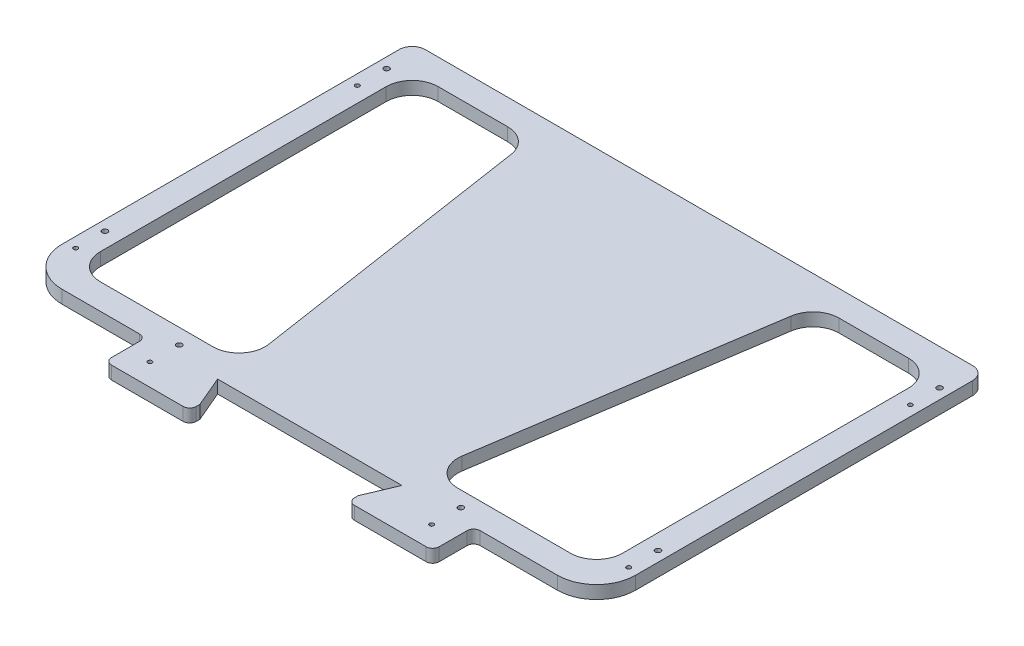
ISO-10303-21;
HEADER;
FILE_DESCRIPTION(('STEP AP214'),'2;1');
FILE_NAME('part.step','',(''),(''),'','','');
FILE_SCHEMA(('AUTOMOTIVE_DESIGN { 1 0 10303 214 1 1 1 1 }'));
ENDSEC;
DATA;
#1=APPLICATION_CONTEXT('core data for automotive mechanical design processes');
#2=APPLICATION_PROTOCOL_DEFINITION('international standard','automotive_design',2000,#1);
#3=PRODUCT_CONTEXT('',#1,'mechanical');
#4=PRODUCT('Part','Part','',(#3));
#5=PRODUCT_RELATED_PRODUCT_CATEGORY('part','',(#4));
#6=PRODUCT_DEFINITION_FORMATION('','',#4);
#7=PRODUCT_DEFINITION_CONTEXT('part definition',#1,'design');
#8=PRODUCT_DEFINITION('design','',#6,#7);
#9=PRODUCT_DEFINITION_SHAPE('','',#8);
#10=(LENGTH_UNIT() NAMED_UNIT(*) SI_UNIT(.MILLI.,.METRE.));
#11=(NAMED_UNIT(*) PLANE_ANGLE_UNIT() SI_UNIT($,.RADIAN.));
#12=(NAMED_UNIT(*) SI_UNIT($,.STERADIAN.) SOLID_ANGLE_UNIT());
#13=UNCERTAINTY_MEASURE_WITH_UNIT(LENGTH_MEASURE(1.E-05),#10,'distance_accuracy_value','');
#14=(GEOMETRIC_REPRESENTATION_CONTEXT(3) GLOBAL_UNCERTAINTY_ASSIGNED_CONTEXT((#13)) GLOBAL_UNIT_ASSIGNED_CONTEXT((#10,
#11,#12)) REPRESENTATION_CONTEXT('',''));
#15=CARTESIAN_POINT('',(0.,0.,0.));
#16=DIRECTION('',(0.,0.,1.));
#17=DIRECTION('',(1.,0.,0.));
#18=AXIS2_PLACEMENT_3D('',#15,#16,#17);
#19=CARTESIAN_POINT('',(0.,0.,40.));
#20=DIRECTION('',(0.,0.,1.));
#21=DIRECTION('',(1.,0.,0.));
#22=AXIS2_PLACEMENT_3D('',#19,#20,#21);
#23=PLANE('',#22);
#24=DIRECTION('',(-1.,0.,0.));
#25=VECTOR('',#24,1.);
#26=CARTESIAN_POINT('',(120.,12.7,40.));
#27=LINE('',#26,#25);
#28=CARTESIAN_POINT('',(433.65,12.7,40.));
#29=VERTEX_POINT('',#28);
#30=CARTESIAN_POINT('',(363.615755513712,12.7,40.));
#31=VERTEX_POINT('',#30);
#32=EDGE_CURVE('E341',#29,#31,#27,.T.);
#33=ORIENTED_EDGE('',*,*,#32,.T.);
#34=DIRECTION('',(0.,1.,0.));
#35=VECTOR('',#34,1.);
#36=CARTESIAN_POINT('',(363.615755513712,0.,40.));
#37=LINE('',#36,#35);
#38=CARTESIAN_POINT('',(363.615755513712,0.,40.));
#39=VERTEX_POINT('',#38);
#40=EDGE_CURVE('E629',#31,#39,#37,.F.);
#41=ORIENTED_EDGE('',*,*,#40,.T.);
#42=DIRECTION('',(1.,0.,0.));
#43=VECTOR('',#42,1.);
#44=CARTESIAN_POINT('',(120.,0.,40.));
#45=LINE('',#44,#43);
#46=CARTESIAN_POINT('',(433.65,0.,40.));
#47=VERTEX_POINT('',#46);
#48=EDGE_CURVE('E297',#39,#47,#45,.T.);
#49=ORIENTED_EDGE('',*,*,#48,.T.);
#50=DIRECTION('',(0.,1.,0.));
#51=VECTOR('',#50,1.);
#52=CARTESIAN_POINT('',(433.65,12.7,40.));
#53=LINE('',#52,#51);
#54=EDGE_CURVE('E598',#47,#29,#53,.T.);
#55=ORIENTED_EDGE('',*,*,#54,.T.);
#56=EDGE_LOOP('',(#33,#41,#49,#55));
#57=FACE_BOUND('',#56,.T.);
#58=ADVANCED_FACE('F32',(#57),#23,.T.);
#59=CARTESIAN_POINT('',(0.,12.7,0.));
#60=DIRECTION('',(0.,0.,-1.));
#61=DIRECTION('',(-1.,0.,0.));
#62=AXIS2_PLACEMENT_3D('',#59,#60,#61);
#63=PLANE('',#62);
#64=DIRECTION('',(1.,0.,0.));
#65=VECTOR('',#64,1.);
#66=CARTESIAN_POINT('',(0.,0.,0.));
#67=LINE('',#66,#65);
#68=CARTESIAN_POINT('',(38.1,0.,0.));
#69=VERTEX_POINT('',#68);
#70=CARTESIAN_POINT('',(113.65,0.,0.));
#71=VERTEX_POINT('',#70);
#72=EDGE_CURVE('E537',#69,#71,#67,.T.);
#73=ORIENTED_EDGE('',*,*,#72,.T.);
#74=DIRECTION('',(0.,-1.,0.));
#75=VECTOR('',#74,1.);
#76=CARTESIAN_POINT('',(113.65,12.7,0.));
#77=LINE('',#76,#75);
#78=CARTESIAN_POINT('',(113.65,12.7,0.));
#79=VERTEX_POINT('',#78);
#80=EDGE_CURVE('E589',#71,#79,#77,.F.);
#81=ORIENTED_EDGE('',*,*,#80,.T.);
#82=DIRECTION('',(1.,0.,0.));
#83=VECTOR('',#82,1.);
#84=CARTESIAN_POINT('',(0.,12.7,0.));
#85=LINE('',#84,#83);
#86=CARTESIAN_POINT('',(38.1,12.7,0.));
#87=VERTEX_POINT('',#86);
#88=EDGE_CURVE('E525',#87,#79,#85,.T.);
#89=ORIENTED_EDGE('',*,*,#88,.F.);
#90=DIRECTION('',(0.,-1.,0.));
#91=VECTOR('',#90,1.);
#92=CARTESIAN_POINT('',(38.1,12.7,0.));
#93=LINE('',#92,#91);
#94=EDGE_CURVE('E553',#87,#69,#93,.T.);
#95=ORIENTED_EDGE('',*,*,#94,.T.);
#96=EDGE_LOOP('',(#73,#81,#89,#95));
#97=FACE_BOUND('',#96,.T.);
#98=ADVANCED_FACE('F659',(#97),#63,.F.);
#99=CARTESIAN_POINT('',(446.35,12.7,0.));
#100=VERTEX_POINT('',#99);
#101=CARTESIAN_POINT('',(521.9,12.7,0.));
#102=VERTEX_POINT('',#101);
#103=EDGE_CURVE('E523',#100,#102,#85,.T.);
#104=ORIENTED_EDGE('',*,*,#103,.F.);
#105=DIRECTION('',(0.,1.,0.));
#106=VECTOR('',#105,1.);
#107=CARTESIAN_POINT('',(446.35,0.,0.));
#108=LINE('',#107,#106);
#109=CARTESIAN_POINT('',(446.35,0.,0.));
#110=VERTEX_POINT('',#109);
#111=EDGE_CURVE('E596',#100,#110,#108,.F.);
#112=ORIENTED_EDGE('',*,*,#111,.T.);
#113=CARTESIAN_POINT('',(521.9,0.,0.));
#114=VERTEX_POINT('',#113);
#115=EDGE_CURVE('E536',#110,#114,#67,.T.);
#116=ORIENTED_EDGE('',*,*,#115,.T.);
#117=DIRECTION('',(0.,-1.,0.));
#118=VECTOR('',#117,1.);
#119=CARTESIAN_POINT('',(521.9,12.7,0.));
#120=LINE('',#119,#118);
#121=EDGE_CURVE('E556',#114,#102,#120,.F.);
#122=ORIENTED_EDGE('',*,*,#121,.T.);
#123=EDGE_LOOP('',(#104,#112,#116,#122));
#124=FACE_BOUND('',#123,.T.);
#125=ADVANCED_FACE('F739',(#124),#63,.F.);
#126=CARTESIAN_POINT('',(0.,12.7,0.));
#127=DIRECTION('',(1.,0.,0.));
#128=DIRECTION('',(0.,0.,-1.));
#129=AXIS2_PLACEMENT_3D('',#126,#127,#128);
#130=PLANE('',#129);
#131=DIRECTION('',(0.,0.,1.));
#132=VECTOR('',#131,1.);
#133=CARTESIAN_POINT('',(0.,12.7,0.));
#134=LINE('',#133,#132);
#135=CARTESIAN_POINT('',(0.,12.7,-367.3));
#136=VERTEX_POINT('',#135);
#137=CARTESIAN_POINT('',(0.,12.7,-38.1));
#138=VERTEX_POINT('',#137);
#139=EDGE_CURVE('E521',#136,#138,#134,.T.);
#140=ORIENTED_EDGE('',*,*,#139,.F.);
#141=DIRECTION('',(0.,-1.,0.));
#142=VECTOR('',#141,1.);
#143=CARTESIAN_POINT('',(0.,12.7,-367.3));
#144=LINE('',#143,#142);
#145=CARTESIAN_POINT('',(0.,0.,-367.3));
#146=VERTEX_POINT('',#145);
#147=EDGE_CURVE('E581',#136,#146,#144,.T.);
#148=ORIENTED_EDGE('',*,*,#147,.T.);
#149=DIRECTION('',(0.,0.,1.));
#150=VECTOR('',#149,1.);
#151=CARTESIAN_POINT('',(0.,0.,0.));
#152=LINE('',#151,#150);
#153=CARTESIAN_POINT('',(0.,0.,-38.1));
#154=VERTEX_POINT('',#153);
#155=EDGE_CURVE('E520',#146,#154,#152,.T.);
#156=ORIENTED_EDGE('',*,*,#155,.T.);
#157=DIRECTION('',(0.,-1.,0.));
#158=VECTOR('',#157,1.);
#159=CARTESIAN_POINT('',(0.,12.7,-38.1));
#160=LINE('',#159,#158);
#161=EDGE_CURVE('E563',#154,#138,#160,.F.);
#162=ORIENTED_EDGE('',*,*,#161,.T.);
#163=EDGE_LOOP('',(#140,#148,#156,#162));
#164=FACE_BOUND('',#163,.T.);
#165=ADVANCED_FACE('F670',(#164),#130,.F.);
#166=CARTESIAN_POINT('',(560.,12.7,0.));
#167=DIRECTION('',(-1.,0.,0.));
#168=DIRECTION('',(0.,0.,1.));
#169=AXIS2_PLACEMENT_3D('',#166,#167,#168);
#170=PLANE('',#169);
#171=DIRECTION('',(0.,0.,-1.));
#172=VECTOR('',#171,1.);
#173=CARTESIAN_POINT('',(560.,0.,0.));
#174=LINE('',#173,#172);
#175=CARTESIAN_POINT('',(560.,0.,-38.1));
#176=VERTEX_POINT('',#175);
#177=CARTESIAN_POINT('',(560.,0.,-367.3));
#178=VERTEX_POINT('',#177);
#179=EDGE_CURVE('E540',#176,#178,#174,.T.);
#180=ORIENTED_EDGE('',*,*,#179,.T.);
#181=DIRECTION('',(0.,-1.,0.));
#182=VECTOR('',#181,1.);
#183=CARTESIAN_POINT('',(560.,12.7,-367.3));
#184=LINE('',#183,#182);
#185=CARTESIAN_POINT('',(560.,12.7,-367.3));
#186=VERTEX_POINT('',#185);
#187=EDGE_CURVE('E575',#178,#186,#184,.F.);
#188=ORIENTED_EDGE('',*,*,#187,.T.);
#189=DIRECTION('',(0.,0.,-1.));
#190=VECTOR('',#189,1.);
#191=CARTESIAN_POINT('',(560.,12.7,0.));
#192=LINE('',#191,#190);
#193=CARTESIAN_POINT('',(560.,12.7,-38.1));
#194=VERTEX_POINT('',#193);
#195=EDGE_CURVE('E528',#194,#186,#192,.T.);
#196=ORIENTED_EDGE('',*,*,#195,.F.);
#197=DIRECTION('',(0.,-1.,0.));
#198=VECTOR('',#197,1.);
#199=CARTESIAN_POINT('',(560.,12.7,-38.1));
#200=LINE('',#199,#198);
#201=EDGE_CURVE('E534',#194,#176,#200,.T.);
#202=ORIENTED_EDGE('',*,*,#201,.T.);
#203=EDGE_LOOP('',(#180,#188,#196,#202));
#204=FACE_BOUND('',#203,.T.);
#205=ADVANCED_FACE('F687',(#204),#170,.F.);
#206=CARTESIAN_POINT('',(0.,12.7,-380.));
#207=DIRECTION('',(0.,0.,1.));
#208=DIRECTION('',(1.,0.,0.));
#209=AXIS2_PLACEMENT_3D('',#206,#207,#208);
#210=PLANE('',#209);
#211=DIRECTION('',(-1.,0.,0.));
#212=VECTOR('',#211,1.);
#213=CARTESIAN_POINT('',(0.,12.7,-380.));
#214=LINE('',#213,#212);
#215=CARTESIAN_POINT('',(547.3,12.7,-380.));
#216=VERTEX_POINT('',#215);
#217=CARTESIAN_POINT('',(12.7,12.7,-380.));
#218=VERTEX_POINT('',#217);
#219=EDGE_CURVE('E531',#216,#218,#214,.T.);
#220=ORIENTED_EDGE('',*,*,#219,.F.);
#221=DIRECTION('',(0.,-1.,0.));
#222=VECTOR('',#221,1.);
#223=CARTESIAN_POINT('',(547.3,12.7,-380.));
#224=LINE('',#223,#222);
#225=CARTESIAN_POINT('',(547.3,0.,-380.));
#226=VERTEX_POINT('',#225);
#227=EDGE_CURVE('E568',#216,#226,#224,.T.);
#228=ORIENTED_EDGE('',*,*,#227,.T.);
#229=DIRECTION('',(-1.,0.,0.));
#230=VECTOR('',#229,1.);
#231=CARTESIAN_POINT('',(0.,0.,-380.));
#232=LINE('',#231,#230);
#233=CARTESIAN_POINT('',(12.7,0.,-380.));
#234=VERTEX_POINT('',#233);
#235=EDGE_CURVE('E524',#226,#234,#232,.T.);
#236=ORIENTED_EDGE('',*,*,#235,.T.);
#237=DIRECTION('',(0.,-1.,0.));
#238=VECTOR('',#237,1.);
#239=CARTESIAN_POINT('',(12.7,12.7,-380.));
#240=LINE('',#239,#238);
#241=EDGE_CURVE('E566',#234,#218,#240,.F.);
#242=ORIENTED_EDGE('',*,*,#241,.T.);
#243=EDGE_LOOP('',(#220,#228,#236,#242));
#244=FACE_BOUND('',#243,.T.);
#245=ADVANCED_FACE('F678',(#244),#210,.F.);
#246=CARTESIAN_POINT('',(0.,12.7,0.));
#247=DIRECTION('',(0.,-1.,0.));
#248=DIRECTION('',(0.,0.,-1.));
#249=AXIS2_PLACEMENT_3D('',#246,#247,#248);
#250=PLANE('',#249);
#251=CARTESIAN_POINT('',(10.,12.7,-316.425));
#252=DIRECTION('',(0.,1.,0.));
#253=DIRECTION('',(0.,0.,1.));
#254=AXIS2_PLACEMENT_3D('',#251,#252,#253);
#255=CIRCLE('',#254,2.09999999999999);
#256=CARTESIAN_POINT('',(10.,12.7,-314.325));
#257=VERTEX_POINT('',#256);
#258=EDGE_CURVE('E937',#257,#257,#255,.T.);
#259=ORIENTED_EDGE('',*,*,#258,.F.);
#260=EDGE_LOOP('',(#259));
#261=FACE_BOUND('',#260,.T.);
#262=CARTESIAN_POINT('',(10.,12.7,-41.425));
#263=DIRECTION('',(0.,1.,0.));
#264=DIRECTION('',(0.,0.,1.));
#265=AXIS2_PLACEMENT_3D('',#262,#263,#264);
#266=CIRCLE('',#265,2.09999999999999);
#267=CARTESIAN_POINT('',(10.,12.7,-39.325));
#268=VERTEX_POINT('',#267);
#269=EDGE_CURVE('E931',#268,#268,#266,.T.);
#270=ORIENTED_EDGE('',*,*,#269,.F.);
#271=EDGE_LOOP('',(#270));
#272=FACE_BOUND('',#271,.T.);
#273=CARTESIAN_POINT('',(142.5,12.7,18.575));
#274=DIRECTION('',(0.,1.,0.));
#275=DIRECTION('',(0.,0.,1.));
#276=AXIS2_PLACEMENT_3D('',#273,#274,#275);
#277=CIRCLE('',#276,2.09999999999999);
#278=CARTESIAN_POINT('',(142.5,12.7,20.675));
#279=VERTEX_POINT('',#278);
#280=EDGE_CURVE('E925',#279,#279,#277,.T.);
#281=ORIENTED_EDGE('',*,*,#280,.F.);
#282=EDGE_LOOP('',(#281));
#283=FACE_BOUND('',#282,.T.);
#284=CARTESIAN_POINT('',(417.5,12.7,18.5749999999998));
#285=DIRECTION('',(0.,1.,0.));
#286=DIRECTION('',(0.,0.,1.));
#287=AXIS2_PLACEMENT_3D('',#284,#285,#286);
#288=CIRCLE('',#287,2.09999999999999);
#289=CARTESIAN_POINT('',(417.5,12.7,20.6749999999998));
#290=VERTEX_POINT('',#289);
#291=EDGE_CURVE('E919',#290,#290,#288,.T.);
#292=ORIENTED_EDGE('',*,*,#291,.F.);
#293=EDGE_LOOP('',(#292));
#294=FACE_BOUND('',#293,.T.);
#295=CARTESIAN_POINT('',(550.,12.7,-41.425));
#296=DIRECTION('',(0.,1.,0.));
#297=DIRECTION('',(0.,0.,1.));
#298=AXIS2_PLACEMENT_3D('',#295,#296,#297);
#299=CIRCLE('',#298,2.09999999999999);
#300=CARTESIAN_POINT('',(550.,12.7,-39.325));
#301=VERTEX_POINT('',#300);
#302=EDGE_CURVE('E911',#301,#301,#299,.T.);
#303=ORIENTED_EDGE('',*,*,#302,.F.);
#304=EDGE_LOOP('',(#303));
#305=FACE_BOUND('',#304,.T.);
#306=CARTESIAN_POINT('',(550.,12.7,-316.425));
#307=DIRECTION('',(0.,1.,0.));
#308=DIRECTION('',(0.,0.,1.));
#309=AXIS2_PLACEMENT_3D('',#306,#307,#308);
#310=CIRCLE('',#309,2.09999999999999);
#311=CARTESIAN_POINT('',(550.,12.7,-314.325));
#312=VERTEX_POINT('',#311);
#313=EDGE_CURVE('E906',#312,#312,#310,.T.);
#314=ORIENTED_EDGE('',*,*,#313,.F.);
#315=EDGE_LOOP('',(#314));
#316=FACE_BOUND('',#315,.T.);
#317=DIRECTION('',(-1.,0.,0.));
#318=VECTOR('',#317,1.);
#319=CARTESIAN_POINT('',(441.841412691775,12.7,-355.));
#320=LINE('',#319,#318);
#321=CARTESIAN_POINT('',(509.6,12.7,-355.));
#322=VERTEX_POINT('',#321);
#323=CARTESIAN_POINT('',(441.841412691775,12.7,-355.));
#324=VERTEX_POINT('',#323);
#325=EDGE_CURVE('E384',#322,#324,#320,.T.);
#326=ORIENTED_EDGE('',*,*,#325,.F.);
#327=CARTESIAN_POINT('',(509.6,12.7,-329.6));
#328=DIRECTION('',(0.,1.,0.));
#329=DIRECTION('',(0.,0.,1.));
#330=AXIS2_PLACEMENT_3D('',#327,#328,#329);
#331=CIRCLE('',#330,25.3999999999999);
#332=CARTESIAN_POINT('',(535.,12.7,-329.6));
#333=VERTEX_POINT('',#332);
#334=EDGE_CURVE('E356',#333,#322,#331,.T.);
#335=ORIENTED_EDGE('',*,*,#334,.F.);
#336=DIRECTION('',(0.,0.,-1.));
#337=VECTOR('',#336,1.);
#338=CARTESIAN_POINT('',(535.,12.7,-329.6));
#339=LINE('',#338,#337);
#340=CARTESIAN_POINT('',(535.,12.7,-50.4000000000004));
#341=VERTEX_POINT('',#340);
#342=EDGE_CURVE('E361',#341,#333,#339,.T.);
#343=ORIENTED_EDGE('',*,*,#342,.F.);
#344=CARTESIAN_POINT('',(509.6,12.7,-50.4000000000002));
#345=DIRECTION('',(0.,1.,0.));
#346=DIRECTION('',(0.,0.,-1.));
#347=AXIS2_PLACEMENT_3D('',#344,#345,#346);
#348=CIRCLE('',#347,25.4);
#349=CARTESIAN_POINT('',(509.6,12.7,-25.0000000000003));
#350=VERTEX_POINT('',#349);
#351=EDGE_CURVE('E399',#350,#341,#348,.T.);
#352=ORIENTED_EDGE('',*,*,#351,.F.);
#353=DIRECTION('',(1.,0.,0.));
#354=VECTOR('',#353,1.);
#355=CARTESIAN_POINT('',(509.6,12.7,-25.0000000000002));
#356=LINE('',#355,#354);
#357=CARTESIAN_POINT('',(399.538382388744,12.7,-25.0000000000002));
#358=VERTEX_POINT('',#357);
#359=EDGE_CURVE('E396',#358,#350,#356,.T.);
#360=ORIENTED_EDGE('',*,*,#359,.F.);
#361=CARTESIAN_POINT('',(399.538382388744,12.7,-50.4000000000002));
#362=DIRECTION('',(0.,1.,0.));
#363=DIRECTION('',(0.,0.,-1.));
#364=AXIS2_PLACEMENT_3D('',#361,#362,#363);
#365=CIRCLE('',#364,25.4);
#366=CARTESIAN_POINT('',(374.425008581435,12.7,-54.2050566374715));
#367=VERTEX_POINT('',#366);
#368=EDGE_CURVE('E393',#367,#358,#365,.T.);
#369=ORIENTED_EDGE('',*,*,#368,.F.);
#370=DIRECTION('',(-0.149805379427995,0.,0.988715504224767));
#371=VECTOR('',#370,1.);
#372=CARTESIAN_POINT('',(374.425008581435,12.7,-54.2050566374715));
#373=LINE('',#372,#371);
#374=CARTESIAN_POINT('',(416.728038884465,12.7,-333.405056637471));
#375=VERTEX_POINT('',#374);
#376=EDGE_CURVE('E390',#375,#367,#373,.T.);
#377=ORIENTED_EDGE('',*,*,#376,.F.);
#378=CARTESIAN_POINT('',(441.841412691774,12.7,-329.6));
#379=DIRECTION('',(0.,1.,0.));
#380=DIRECTION('',(0.,0.,-1.));
#381=AXIS2_PLACEMENT_3D('',#378,#379,#380);
#382=CIRCLE('',#381,25.4);
#383=EDGE_CURVE('E387',#324,#375,#382,.T.);
#384=ORIENTED_EDGE('',*,*,#383,.F.);
#385=EDGE_LOOP('',(#326,#335,#343,#352,#360,#369,#377,#384));
#386=FACE_BOUND('',#385,.T.);
#387=DIRECTION('',(-1.,0.,0.));
#388=VECTOR('',#387,1.);
#389=CARTESIAN_POINT('',(118.158587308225,12.7,-355.));
#390=LINE('',#389,#388);
#391=CARTESIAN_POINT('',(118.158587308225,12.7,-355.));
#392=VERTEX_POINT('',#391);
#393=CARTESIAN_POINT('',(50.4000000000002,12.7,-355.));
#394=VERTEX_POINT('',#393);
#395=EDGE_CURVE('E448',#392,#394,#390,.T.);
#396=ORIENTED_EDGE('',*,*,#395,.F.);
#397=CARTESIAN_POINT('',(118.158587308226,12.7,-329.6));
#398=DIRECTION('',(0.,1.,0.));
#399=DIRECTION('',(0.,0.,1.));
#400=AXIS2_PLACEMENT_3D('',#397,#398,#399);
#401=CIRCLE('',#400,25.4);
#402=CARTESIAN_POINT('',(143.271961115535,12.7,-333.405056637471));
#403=VERTEX_POINT('',#402);
#404=EDGE_CURVE('E406',#403,#392,#401,.T.);
#405=ORIENTED_EDGE('',*,*,#404,.F.);
#406=DIRECTION('',(-0.149805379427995,0.,-0.988715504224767));
#407=VECTOR('',#406,1.);
#408=CARTESIAN_POINT('',(185.574991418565,12.7,-54.2050566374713));
#409=LINE('',#408,#407);
#410=CARTESIAN_POINT('',(185.574991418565,12.7,-54.2050566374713));
#411=VERTEX_POINT('',#410);
#412=EDGE_CURVE('E425',#411,#403,#409,.T.);
#413=ORIENTED_EDGE('',*,*,#412,.F.);
#414=CARTESIAN_POINT('',(160.461617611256,12.7,-50.4));
#415=DIRECTION('',(0.,1.,0.));
#416=DIRECTION('',(0.,0.,1.));
#417=AXIS2_PLACEMENT_3D('',#414,#415,#416);
#418=CIRCLE('',#417,25.4);
#419=CARTESIAN_POINT('',(160.461617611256,12.7,-25.));
#420=VERTEX_POINT('',#419);
#421=EDGE_CURVE('E463',#420,#411,#418,.T.);
#422=ORIENTED_EDGE('',*,*,#421,.F.);
#423=DIRECTION('',(1.,0.,0.));
#424=VECTOR('',#423,1.);
#425=CARTESIAN_POINT('',(50.4000000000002,12.7,-25.));
#426=LINE('',#425,#424);
#427=CARTESIAN_POINT('',(50.4000000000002,12.7,-25.));
#428=VERTEX_POINT('',#427);
#429=EDGE_CURVE('E460',#428,#420,#426,.T.);
#430=ORIENTED_EDGE('',*,*,#429,.F.);
#431=CARTESIAN_POINT('',(50.4,12.7,-50.4));
#432=DIRECTION('',(0.,1.,0.));
#433=DIRECTION('',(0.,0.,1.));
#434=AXIS2_PLACEMENT_3D('',#431,#432,#433);
#435=CIRCLE('',#434,25.4);
#436=CARTESIAN_POINT('',(25.,12.7,-50.4000000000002));
#437=VERTEX_POINT('',#436);
#438=EDGE_CURVE('E457',#437,#428,#435,.T.);
#439=ORIENTED_EDGE('',*,*,#438,.F.);
#440=DIRECTION('',(0.,0.,1.));
#441=VECTOR('',#440,1.);
#442=CARTESIAN_POINT('',(25.,12.7,-329.6));
#443=LINE('',#442,#441);
#444=CARTESIAN_POINT('',(25.,12.7,-329.6));
#445=VERTEX_POINT('',#444);
#446=EDGE_CURVE('E454',#445,#437,#443,.T.);
#447=ORIENTED_EDGE('',*,*,#446,.F.);
#448=CARTESIAN_POINT('',(50.4,12.7,-329.6));
#449=DIRECTION('',(0.,1.,0.));
#450=DIRECTION('',(0.,0.,-1.));
#451=AXIS2_PLACEMENT_3D('',#448,#449,#450);
#452=CIRCLE('',#451,25.4);
#453=EDGE_CURVE('E451',#394,#445,#452,.T.);
#454=ORIENTED_EDGE('',*,*,#453,.F.);
#455=EDGE_LOOP('',(#396,#405,#413,#422,#430,#439,#447,#454));
#456=FACE_BOUND('',#455,.T.);
#457=CARTESIAN_POINT('',(10.,12.7,-70.));
#458=DIRECTION('',(0.,1.,0.));
#459=DIRECTION('',(0.,0.,1.));
#460=AXIS2_PLACEMENT_3D('',#457,#458,#459);
#461=CIRCLE('',#460,2.64999999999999);
#462=CARTESIAN_POINT('',(10.,12.7,-67.35));
#463=VERTEX_POINT('',#462);
#464=EDGE_CURVE('E470',#463,#463,#461,.T.);
#465=ORIENTED_EDGE('',*,*,#464,.F.);
#466=EDGE_LOOP('',(#465));
#467=FACE_BOUND('',#466,.T.);
#468=CARTESIAN_POINT('',(10.,12.7,-345.));
#469=DIRECTION('',(0.,1.,0.));
#470=DIRECTION('',(0.,0.,1.));
#471=AXIS2_PLACEMENT_3D('',#468,#469,#470);
#472=CIRCLE('',#471,2.64999999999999);
#473=CARTESIAN_POINT('',(10.,12.7,-342.35));
#474=VERTEX_POINT('',#473);
#475=EDGE_CURVE('E490',#474,#474,#472,.T.);
#476=ORIENTED_EDGE('',*,*,#475,.F.);
#477=EDGE_LOOP('',(#476));
#478=FACE_BOUND('',#477,.T.);
#479=CARTESIAN_POINT('',(550.,12.7,-345.));
#480=DIRECTION('',(0.,1.,0.));
#481=DIRECTION('',(0.,0.,1.));
#482=AXIS2_PLACEMENT_3D('',#479,#480,#481);
#483=CIRCLE('',#482,2.65000000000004);
#484=CARTESIAN_POINT('',(550.,12.7,-342.35));
#485=VERTEX_POINT('',#484);
#486=EDGE_CURVE('E496',#485,#485,#483,.T.);
#487=ORIENTED_EDGE('',*,*,#486,.F.);
#488=EDGE_LOOP('',(#487));
#489=FACE_BOUND('',#488,.T.);
#490=CARTESIAN_POINT('',(550.,12.7,-70.));
#491=DIRECTION('',(0.,1.,0.));
#492=DIRECTION('',(0.,0.,1.));
#493=AXIS2_PLACEMENT_3D('',#490,#491,#492);
#494=CIRCLE('',#493,2.65000000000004);
#495=CARTESIAN_POINT('',(550.,12.7,-67.35));
#496=VERTEX_POINT('',#495);
#497=EDGE_CURVE('E502',#496,#496,#494,.T.);
#498=ORIENTED_EDGE('',*,*,#497,.F.);
#499=EDGE_LOOP('',(#498));
#500=FACE_BOUND('',#499,.T.);
#501=CARTESIAN_POINT('',(142.5,12.7,-10.));
#502=DIRECTION('',(0.,1.,0.));
#503=DIRECTION('',(0.,0.,1.));
#504=AXIS2_PLACEMENT_3D('',#501,#502,#503);
#505=CIRCLE('',#504,2.64999999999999);
#506=CARTESIAN_POINT('',(142.5,12.7,-7.35000000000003));
#507=VERTEX_POINT('',#506);
#508=EDGE_CURVE('E508',#507,#507,#505,.T.);
#509=ORIENTED_EDGE('',*,*,#508,.F.);
#510=EDGE_LOOP('',(#509));
#511=FACE_BOUND('',#510,.T.);
#512=CARTESIAN_POINT('',(417.5,12.7,-10.0000000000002));
#513=DIRECTION('',(0.,1.,0.));
#514=DIRECTION('',(0.,0.,1.));
#515=AXIS2_PLACEMENT_3D('',#512,#513,#514);
#516=CIRCLE('',#515,2.64999999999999);
#517=CARTESIAN_POINT('',(417.5,12.7,-7.35000000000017));
#518=VERTEX_POINT('',#517);
#519=EDGE_CURVE('E514',#518,#518,#516,.T.);
#520=ORIENTED_EDGE('',*,*,#519,.F.);
#521=EDGE_LOOP('',(#520));
#522=FACE_BOUND('',#521,.T.);
#523=DIRECTION('',(0.,0.,-1.));
#524=VECTOR('',#523,1.);
#525=CARTESIAN_POINT('',(357.265755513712,12.7,40.));
#526=LINE('',#525,#524);
#527=CARTESIAN_POINT('',(357.265755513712,12.7,33.65));
#528=VERTEX_POINT('',#527);
#529=CARTESIAN_POINT('',(357.265755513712,12.7,30.));
#530=VERTEX_POINT('',#529);
#531=EDGE_CURVE('E329',#528,#530,#526,.T.);
#532=ORIENTED_EDGE('',*,*,#531,.F.);
#533=CARTESIAN_POINT('',(363.615755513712,12.7,33.65));
#534=DIRECTION('',(0.,-1.,0.));
#535=DIRECTION('',(0.,0.,-1.));
#536=AXIS2_PLACEMENT_3D('',#533,#534,#535);
#537=CIRCLE('',#536,6.35);
#538=EDGE_CURVE('E627',#528,#31,#537,.F.);
#539=ORIENTED_EDGE('',*,*,#538,.T.);
#540=ORIENTED_EDGE('',*,*,#32,.F.);
#541=CARTESIAN_POINT('',(433.65,12.7,33.65));
#542=DIRECTION('',(0.,-1.,0.));
#543=DIRECTION('',(0.,0.,-1.));
#544=AXIS2_PLACEMENT_3D('',#541,#542,#543);
#545=CIRCLE('',#544,6.35);
#546=CARTESIAN_POINT('',(440.,12.7,33.65));
#547=VERTEX_POINT('',#546);
#548=EDGE_CURVE('E609',#29,#547,#545,.F.);
#549=ORIENTED_EDGE('',*,*,#548,.T.);
#550=DIRECTION('',(0.,0.,-1.));
#551=VECTOR('',#550,1.);
#552=CARTESIAN_POINT('',(440.,12.7,40.));
#553=LINE('',#552,#551);
#554=CARTESIAN_POINT('',(440.,12.7,6.35));
#555=VERTEX_POINT('',#554);
#556=EDGE_CURVE('E347',#547,#555,#553,.T.);
#557=ORIENTED_EDGE('',*,*,#556,.T.);
#558=CARTESIAN_POINT('',(446.35,12.7,6.35));
#559=DIRECTION('',(0.,-1.,0.));
#560=DIRECTION('',(0.,0.,-1.));
#561=AXIS2_PLACEMENT_3D('',#558,#559,#560);
#562=CIRCLE('',#561,6.35);
#563=EDGE_CURVE('E618',#555,#100,#562,.T.);
#564=ORIENTED_EDGE('',*,*,#563,.T.);
#565=ORIENTED_EDGE('',*,*,#103,.T.);
#566=CARTESIAN_POINT('',(521.9,12.7,-38.1));
#567=DIRECTION('',(0.,-1.,0.));
#568=DIRECTION('',(0.,0.,-1.));
#569=AXIS2_PLACEMENT_3D('',#566,#567,#568);
#570=CIRCLE('',#569,38.1);
#571=EDGE_CURVE('E561',#102,#194,#570,.F.);
#572=ORIENTED_EDGE('',*,*,#571,.T.);
#573=ORIENTED_EDGE('',*,*,#195,.T.);
#574=CARTESIAN_POINT('',(547.3,12.7,-367.3));
#575=DIRECTION('',(0.,-1.,0.));
#576=DIRECTION('',(0.,0.,-1.));
#577=AXIS2_PLACEMENT_3D('',#574,#575,#576);
#578=CIRCLE('',#577,12.7);
#579=EDGE_CURVE('E579',#186,#216,#578,.F.);
#580=ORIENTED_EDGE('',*,*,#579,.T.);
#581=ORIENTED_EDGE('',*,*,#219,.T.);
#582=CARTESIAN_POINT('',(12.7,12.7,-367.3));
#583=DIRECTION('',(0.,-1.,0.));
#584=DIRECTION('',(0.,0.,-1.));
#585=AXIS2_PLACEMENT_3D('',#582,#583,#584);
#586=CIRCLE('',#585,12.7);
#587=EDGE_CURVE('E577',#218,#136,#586,.F.);
#588=ORIENTED_EDGE('',*,*,#587,.T.);
#589=ORIENTED_EDGE('',*,*,#139,.T.);
#590=CARTESIAN_POINT('',(38.1,12.7,-38.1));
#591=DIRECTION('',(0.,-1.,0.));
#592=DIRECTION('',(0.,0.,-1.));
#593=AXIS2_PLACEMENT_3D('',#590,#591,#592);
#594=CIRCLE('',#593,38.1);
#595=EDGE_CURVE('E559',#138,#87,#594,.F.);
#596=ORIENTED_EDGE('',*,*,#595,.T.);
#597=ORIENTED_EDGE('',*,*,#88,.T.);
#598=CARTESIAN_POINT('',(113.65,12.7,6.35));
#599=DIRECTION('',(0.,-1.,0.));
#600=DIRECTION('',(0.,0.,-1.));
#601=AXIS2_PLACEMENT_3D('',#598,#599,#600);
#602=CIRCLE('',#601,6.35);
#603=CARTESIAN_POINT('',(120.,12.7,6.35));
#604=VERTEX_POINT('',#603);
#605=EDGE_CURVE('E616',#79,#604,#602,.T.);
#606=ORIENTED_EDGE('',*,*,#605,.T.);
#607=DIRECTION('',(0.,0.,-1.));
#608=VECTOR('',#607,1.);
#609=CARTESIAN_POINT('',(120.,12.7,40.));
#610=LINE('',#609,#608);
#611=CARTESIAN_POINT('',(120.,12.7,33.65));
#612=VERTEX_POINT('',#611);
#613=EDGE_CURVE('E344',#612,#604,#610,.T.);
#614=ORIENTED_EDGE('',*,*,#613,.F.);
#615=CARTESIAN_POINT('',(126.35,12.7,33.65));
#616=DIRECTION('',(0.,-1.,0.));
#617=DIRECTION('',(0.,0.,-1.));
#618=AXIS2_PLACEMENT_3D('',#615,#616,#617);
#619=CIRCLE('',#618,6.35);
#620=CARTESIAN_POINT('',(126.35,12.7,40.));
#621=VERTEX_POINT('',#620);
#622=EDGE_CURVE('E611',#612,#621,#619,.F.);
#623=ORIENTED_EDGE('',*,*,#622,.T.);
#624=CARTESIAN_POINT('',(196.384244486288,12.7,40.));
#625=VERTEX_POINT('',#624);
#626=EDGE_CURVE('E340',#625,#621,#27,.T.);
#627=ORIENTED_EDGE('',*,*,#626,.F.);
#628=CARTESIAN_POINT('',(196.384244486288,12.7,33.65));
#629=DIRECTION('',(0.,-1.,0.));
#630=DIRECTION('',(0.,0.,-1.));
#631=AXIS2_PLACEMENT_3D('',#628,#629,#630);
#632=CIRCLE('',#631,6.35);
#633=CARTESIAN_POINT('',(202.734244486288,12.7,33.65));
#634=VERTEX_POINT('',#633);
#635=EDGE_CURVE('E625',#625,#634,#632,.F.);
#636=ORIENTED_EDGE('',*,*,#635,.T.);
#637=DIRECTION('',(0.,0.,1.));
#638=VECTOR('',#637,1.);
#639=CARTESIAN_POINT('',(202.734244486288,12.7,30.));
#640=LINE('',#639,#638);
#641=CARTESIAN_POINT('',(202.734244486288,12.7,30.));
#642=VERTEX_POINT('',#641);
#643=EDGE_CURVE('E327',#642,#634,#640,.T.);
#644=ORIENTED_EDGE('',*,*,#643,.F.);
#645=DIRECTION('',(0.390731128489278,0.,0.920504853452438));
#646=VECTOR('',#645,1.);
#647=CARTESIAN_POINT('',(202.734244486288,12.7,30.));
#648=LINE('',#647,#646);
#649=CARTESIAN_POINT('',(190.,12.7,0.));
#650=VERTEX_POINT('',#649);
#651=EDGE_CURVE('E325',#650,#642,#648,.T.);
#652=ORIENTED_EDGE('',*,*,#651,.F.);
#653=DIRECTION('',(-1.,0.,0.));
#654=VECTOR('',#653,1.);
#655=CARTESIAN_POINT('',(190.,12.7,0.));
#656=LINE('',#655,#654);
#657=CARTESIAN_POINT('',(370.,12.7,0.));
#658=VERTEX_POINT('',#657);
#659=EDGE_CURVE('E305',#658,#650,#656,.T.);
#660=ORIENTED_EDGE('',*,*,#659,.F.);
#661=DIRECTION('',(0.390731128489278,0.,-0.920504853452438));
#662=VECTOR('',#661,1.);
#663=CARTESIAN_POINT('',(370.,12.7,0.));
#664=LINE('',#663,#662);
#665=EDGE_CURVE('E307',#530,#658,#664,.T.);
#666=ORIENTED_EDGE('',*,*,#665,.F.);
#667=EDGE_LOOP('',(#532,#539,#540,#549,#557,#564,#565,#572,#573,#580,#581,#588,#589,#596,#597,
#606,#614,#623,#627,#636,#644,#652,#660,#666));
#668=FACE_BOUND('',#667,.T.);
#669=ADVANCED_FACE('F641',(#261,#272,#283,#294,#305,#316,#386,#456,#467,#478,#489,#500,#511,
#522,#668),#250,.F.);
#670=CARTESIAN_POINT('',(0.,0.,0.));
#671=DIRECTION('',(0.,-1.,0.));
#672=DIRECTION('',(0.,0.,-1.));
#673=AXIS2_PLACEMENT_3D('',#670,#671,#672);
#674=PLANE('',#673);
#675=CARTESIAN_POINT('',(10.,0.,-316.425));
#676=DIRECTION('',(0.,1.,0.));
#677=DIRECTION('',(0.,0.,1.));
#678=AXIS2_PLACEMENT_3D('',#675,#676,#677);
#679=CIRCLE('',#678,2.09999999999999);
#680=CARTESIAN_POINT('',(10.,0.,-314.325));
#681=VERTEX_POINT('',#680);
#682=EDGE_CURVE('E934',#681,#681,#679,.T.);
#683=ORIENTED_EDGE('',*,*,#682,.T.);
#684=EDGE_LOOP('',(#683));
#685=FACE_BOUND('',#684,.T.);
#686=CARTESIAN_POINT('',(10.,0.,-41.425));
#687=DIRECTION('',(0.,1.,0.));
#688=DIRECTION('',(0.,0.,1.));
#689=AXIS2_PLACEMENT_3D('',#686,#687,#688);
#690=CIRCLE('',#689,2.09999999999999);
#691=CARTESIAN_POINT('',(10.,0.,-39.325));
#692=VERTEX_POINT('',#691);
#693=EDGE_CURVE('E928',#692,#692,#690,.T.);
#694=ORIENTED_EDGE('',*,*,#693,.T.);
#695=EDGE_LOOP('',(#694));
#696=FACE_BOUND('',#695,.T.);
#697=CARTESIAN_POINT('',(142.5,0.,18.575));
#698=DIRECTION('',(0.,1.,0.));
#699=DIRECTION('',(0.,0.,1.));
#700=AXIS2_PLACEMENT_3D('',#697,#698,#699);
#701=CIRCLE('',#700,2.09999999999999);
#702=CARTESIAN_POINT('',(142.5,0.,20.675));
#703=VERTEX_POINT('',#702);
#704=EDGE_CURVE('E922',#703,#703,#701,.T.);
#705=ORIENTED_EDGE('',*,*,#704,.T.);
#706=EDGE_LOOP('',(#705));
#707=FACE_BOUND('',#706,.T.);
#708=CARTESIAN_POINT('',(417.5,0.,18.5749999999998));
#709=DIRECTION('',(0.,1.,0.));
#710=DIRECTION('',(0.,0.,1.));
#711=AXIS2_PLACEMENT_3D('',#708,#709,#710);
#712=CIRCLE('',#711,2.09999999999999);
#713=CARTESIAN_POINT('',(417.5,0.,20.6749999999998));
#714=VERTEX_POINT('',#713);
#715=EDGE_CURVE('E916',#714,#714,#712,.T.);
#716=ORIENTED_EDGE('',*,*,#715,.T.);
#717=EDGE_LOOP('',(#716));
#718=FACE_BOUND('',#717,.T.);
#719=CARTESIAN_POINT('',(550.,0.,-41.425));
#720=DIRECTION('',(0.,1.,0.));
#721=DIRECTION('',(0.,0.,1.));
#722=AXIS2_PLACEMENT_3D('',#719,#720,#721);
#723=CIRCLE('',#722,2.09999999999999);
#724=CARTESIAN_POINT('',(550.,0.,-39.325));
#725=VERTEX_POINT('',#724);
#726=EDGE_CURVE('E908',#725,#725,#723,.T.);
#727=ORIENTED_EDGE('',*,*,#726,.T.);
#728=EDGE_LOOP('',(#727));
#729=FACE_BOUND('',#728,.T.);
#730=CARTESIAN_POINT('',(550.,0.,-316.425));
#731=DIRECTION('',(0.,1.,0.));
#732=DIRECTION('',(0.,0.,1.));
#733=AXIS2_PLACEMENT_3D('',#730,#731,#732);
#734=CIRCLE('',#733,2.09999999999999);
#735=CARTESIAN_POINT('',(550.,0.,-314.325));
#736=VERTEX_POINT('',#735);
#737=EDGE_CURVE('E319',#736,#736,#734,.T.);
#738=ORIENTED_EDGE('',*,*,#737,.T.);
#739=EDGE_LOOP('',(#738));
#740=FACE_BOUND('',#739,.T.);
#741=ORIENTED_EDGE('',*,*,#48,.F.);
#742=CARTESIAN_POINT('',(363.615755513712,0.,33.65));
#743=DIRECTION('',(0.,-1.,0.));
#744=DIRECTION('',(0.,0.,-1.));
#745=AXIS2_PLACEMENT_3D('',#742,#743,#744);
#746=CIRCLE('',#745,6.35);
#747=CARTESIAN_POINT('',(357.265755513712,0.,33.65));
#748=VERTEX_POINT('',#747);
#749=EDGE_CURVE('E632',#39,#748,#746,.T.);
#750=ORIENTED_EDGE('',*,*,#749,.T.);
#751=DIRECTION('',(0.,0.,-1.));
#752=VECTOR('',#751,1.);
#753=CARTESIAN_POINT('',(357.265755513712,0.,40.));
#754=LINE('',#753,#752);
#755=CARTESIAN_POINT('',(357.265755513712,0.,30.));
#756=VERTEX_POINT('',#755);
#757=EDGE_CURVE('E317',#748,#756,#754,.T.);
#758=ORIENTED_EDGE('',*,*,#757,.T.);
#759=DIRECTION('',(0.390731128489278,0.,-0.920504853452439));
#760=VECTOR('',#759,1.);
#761=CARTESIAN_POINT('',(370.,0.,0.));
#762=LINE('',#761,#760);
#763=CARTESIAN_POINT('',(370.,0.,0.));
#764=VERTEX_POINT('',#763);
#765=EDGE_CURVE('E314',#756,#764,#762,.T.);
#766=ORIENTED_EDGE('',*,*,#765,.T.);
#767=DIRECTION('',(-1.,0.,0.));
#768=VECTOR('',#767,1.);
#769=CARTESIAN_POINT('',(190.,0.,0.));
#770=LINE('',#769,#768);
#771=CARTESIAN_POINT('',(190.,0.,0.));
#772=VERTEX_POINT('',#771);
#773=EDGE_CURVE('E302',#764,#772,#770,.T.);
#774=ORIENTED_EDGE('',*,*,#773,.T.);
#775=DIRECTION('',(0.390731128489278,0.,0.920504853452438));
#776=VECTOR('',#775,1.);
#777=CARTESIAN_POINT('',(202.734244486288,0.,30.));
#778=LINE('',#777,#776);
#779=CARTESIAN_POINT('',(202.734244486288,0.,30.));
#780=VERTEX_POINT('',#779);
#781=EDGE_CURVE('E289',#772,#780,#778,.T.);
#782=ORIENTED_EDGE('',*,*,#781,.T.);
#783=DIRECTION('',(0.,0.,1.));
#784=VECTOR('',#783,1.);
#785=CARTESIAN_POINT('',(202.734244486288,0.,30.));
#786=LINE('',#785,#784);
#787=CARTESIAN_POINT('',(202.734244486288,0.,33.65));
#788=VERTEX_POINT('',#787);
#789=EDGE_CURVE('E315',#780,#788,#786,.T.);
#790=ORIENTED_EDGE('',*,*,#789,.T.);
#791=CARTESIAN_POINT('',(196.384244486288,0.,33.65));
#792=DIRECTION('',(0.,-1.,0.));
#793=DIRECTION('',(0.,0.,-1.));
#794=AXIS2_PLACEMENT_3D('',#791,#792,#793);
#795=CIRCLE('',#794,6.35);
#796=CARTESIAN_POINT('',(196.384244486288,0.,40.));
#797=VERTEX_POINT('',#796);
#798=EDGE_CURVE('E47',#788,#797,#795,.T.);
#799=ORIENTED_EDGE('',*,*,#798,.T.);
#800=CARTESIAN_POINT('',(126.35,0.,40.));
#801=VERTEX_POINT('',#800);
#802=EDGE_CURVE('E338',#801,#797,#45,.T.);
#803=ORIENTED_EDGE('',*,*,#802,.F.);
#804=CARTESIAN_POINT('',(126.35,0.,33.65));
#805=DIRECTION('',(0.,-1.,0.));
#806=DIRECTION('',(0.,0.,-1.));
#807=AXIS2_PLACEMENT_3D('',#804,#805,#806);
#808=CIRCLE('',#807,6.35);
#809=CARTESIAN_POINT('',(120.,0.,33.65));
#810=VERTEX_POINT('',#809);
#811=EDGE_CURVE('E607',#801,#810,#808,.T.);
#812=ORIENTED_EDGE('',*,*,#811,.T.);
#813=DIRECTION('',(0.,0.,-1.));
#814=VECTOR('',#813,1.);
#815=CARTESIAN_POINT('',(120.,0.,40.));
#816=LINE('',#815,#814);
#817=CARTESIAN_POINT('',(120.,0.,6.35));
#818=VERTEX_POINT('',#817);
#819=EDGE_CURVE('E353',#810,#818,#816,.T.);
#820=ORIENTED_EDGE('',*,*,#819,.T.);
#821=CARTESIAN_POINT('',(113.65,0.,6.35));
#822=DIRECTION('',(0.,-1.,0.));
#823=DIRECTION('',(0.,0.,-1.));
#824=AXIS2_PLACEMENT_3D('',#821,#822,#823);
#825=CIRCLE('',#824,6.35);
#826=EDGE_CURVE('E614',#818,#71,#825,.F.);
#827=ORIENTED_EDGE('',*,*,#826,.T.);
#828=ORIENTED_EDGE('',*,*,#72,.F.);
#829=CARTESIAN_POINT('',(38.1,0.,-38.1));
#830=DIRECTION('',(0.,-1.,0.));
#831=DIRECTION('',(0.,0.,-1.));
#832=AXIS2_PLACEMENT_3D('',#829,#830,#831);
#833=CIRCLE('',#832,38.1);
#834=EDGE_CURVE('E547',#69,#154,#833,.T.);
#835=ORIENTED_EDGE('',*,*,#834,.T.);
#836=ORIENTED_EDGE('',*,*,#155,.F.);
#837=CARTESIAN_POINT('',(12.7,0.,-367.3));
#838=DIRECTION('',(0.,-1.,0.));
#839=DIRECTION('',(0.,0.,-1.));
#840=AXIS2_PLACEMENT_3D('',#837,#838,#839);
#841=CIRCLE('',#840,12.7);
#842=EDGE_CURVE('E571',#146,#234,#841,.T.);
#843=ORIENTED_EDGE('',*,*,#842,.T.);
#844=ORIENTED_EDGE('',*,*,#235,.F.);
#845=CARTESIAN_POINT('',(547.3,0.,-367.3));
#846=DIRECTION('',(0.,-1.,0.));
#847=DIRECTION('',(0.,0.,-1.));
#848=AXIS2_PLACEMENT_3D('',#845,#846,#847);
#849=CIRCLE('',#848,12.7);
#850=EDGE_CURVE('E573',#226,#178,#849,.T.);
#851=ORIENTED_EDGE('',*,*,#850,.T.);
#852=ORIENTED_EDGE('',*,*,#179,.F.);
#853=CARTESIAN_POINT('',(521.9,0.,-38.1));
#854=DIRECTION('',(0.,-1.,0.));
#855=DIRECTION('',(0.,0.,-1.));
#856=AXIS2_PLACEMENT_3D('',#853,#854,#855);
#857=CIRCLE('',#856,38.1);
#858=EDGE_CURVE('E550',#176,#114,#857,.T.);
#859=ORIENTED_EDGE('',*,*,#858,.T.);
#860=ORIENTED_EDGE('',*,*,#115,.F.);
#861=CARTESIAN_POINT('',(446.35,0.,6.35));
#862=DIRECTION('',(0.,-1.,0.));
#863=DIRECTION('',(0.,0.,-1.));
#864=AXIS2_PLACEMENT_3D('',#861,#862,#863);
#865=CIRCLE('',#864,6.35);
#866=CARTESIAN_POINT('',(440.,0.,6.35));
#867=VERTEX_POINT('',#866);
#868=EDGE_CURVE('E620',#110,#867,#865,.F.);
#869=ORIENTED_EDGE('',*,*,#868,.T.);
#870=DIRECTION('',(0.,0.,-1.));
#871=VECTOR('',#870,1.);
#872=CARTESIAN_POINT('',(440.,0.,40.));
#873=LINE('',#872,#871);
#874=CARTESIAN_POINT('',(440.,0.,33.65));
#875=VERTEX_POINT('',#874);
#876=EDGE_CURVE('E350',#875,#867,#873,.T.);
#877=ORIENTED_EDGE('',*,*,#876,.F.);
#878=CARTESIAN_POINT('',(433.65,0.,33.65));
#879=DIRECTION('',(0.,-1.,0.));
#880=DIRECTION('',(0.,0.,-1.));
#881=AXIS2_PLACEMENT_3D('',#878,#879,#880);
#882=CIRCLE('',#881,6.35);
#883=EDGE_CURVE('E604',#875,#47,#882,.T.);
#884=ORIENTED_EDGE('',*,*,#883,.T.);
#885=EDGE_LOOP('',(#741,#750,#758,#766,#774,#782,#790,#799,#803,#812,#820,#827,#828,#835,#836,
#843,#844,#851,#852,#859,#860,#869,#877,#884));
#886=FACE_BOUND('',#885,.T.);
#887=CARTESIAN_POINT('',(509.6,0.,-329.6));
#888=DIRECTION('',(0.,1.,0.));
#889=DIRECTION('',(0.,0.,1.));
#890=AXIS2_PLACEMENT_3D('',#887,#888,#889);
#891=CIRCLE('',#890,25.3999999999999);
#892=CARTESIAN_POINT('',(535.,0.,-329.6));
#893=VERTEX_POINT('',#892);
#894=CARTESIAN_POINT('',(509.6,0.,-355.));
#895=VERTEX_POINT('',#894);
#896=EDGE_CURVE('E357',#893,#895,#891,.T.);
#897=ORIENTED_EDGE('',*,*,#896,.T.);
#898=DIRECTION('',(-1.,0.,0.));
#899=VECTOR('',#898,1.);
#900=CARTESIAN_POINT('',(441.841412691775,0.,-355.));
#901=LINE('',#900,#899);
#902=CARTESIAN_POINT('',(441.841412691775,0.,-355.));
#903=VERTEX_POINT('',#902);
#904=EDGE_CURVE('E360',#895,#903,#901,.T.);
#905=ORIENTED_EDGE('',*,*,#904,.T.);
#906=CARTESIAN_POINT('',(441.841412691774,0.,-329.6));
#907=DIRECTION('',(0.,1.,0.));
#908=DIRECTION('',(0.,0.,-1.));
#909=AXIS2_PLACEMENT_3D('',#906,#907,#908);
#910=CIRCLE('',#909,25.4);
#911=CARTESIAN_POINT('',(416.728038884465,0.,-333.405056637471));
#912=VERTEX_POINT('',#911);
#913=EDGE_CURVE('E364',#903,#912,#910,.T.);
#914=ORIENTED_EDGE('',*,*,#913,.T.);
#915=DIRECTION('',(-0.149805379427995,0.,0.988715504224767));
#916=VECTOR('',#915,1.);
#917=CARTESIAN_POINT('',(374.425008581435,0.,-54.2050566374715));
#918=LINE('',#917,#916);
#919=CARTESIAN_POINT('',(374.425008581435,0.,-54.2050566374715));
#920=VERTEX_POINT('',#919);
#921=EDGE_CURVE('E367',#912,#920,#918,.T.);
#922=ORIENTED_EDGE('',*,*,#921,.T.);
#923=CARTESIAN_POINT('',(399.538382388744,0.,-50.4000000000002));
#924=DIRECTION('',(0.,1.,0.));
#925=DIRECTION('',(0.,0.,-1.));
#926=AXIS2_PLACEMENT_3D('',#923,#924,#925);
#927=CIRCLE('',#926,25.4);
#928=CARTESIAN_POINT('',(399.538382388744,0.,-25.0000000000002));
#929=VERTEX_POINT('',#928);
#930=EDGE_CURVE('E370',#920,#929,#927,.T.);
#931=ORIENTED_EDGE('',*,*,#930,.T.);
#932=DIRECTION('',(1.,0.,0.));
#933=VECTOR('',#932,1.);
#934=CARTESIAN_POINT('',(509.6,0.,-25.0000000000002));
#935=LINE('',#934,#933);
#936=CARTESIAN_POINT('',(509.6,0.,-25.0000000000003));
#937=VERTEX_POINT('',#936);
#938=EDGE_CURVE('E373',#929,#937,#935,.T.);
#939=ORIENTED_EDGE('',*,*,#938,.T.);
#940=CARTESIAN_POINT('',(509.6,0.,-50.4000000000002));
#941=DIRECTION('',(0.,1.,0.));
#942=DIRECTION('',(0.,0.,-1.));
#943=AXIS2_PLACEMENT_3D('',#940,#941,#942);
#944=CIRCLE('',#943,25.4);
#945=CARTESIAN_POINT('',(535.,0.,-50.4000000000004));
#946=VERTEX_POINT('',#945);
#947=EDGE_CURVE('E376',#937,#946,#944,.T.);
#948=ORIENTED_EDGE('',*,*,#947,.T.);
#949=DIRECTION('',(0.,0.,-1.));
#950=VECTOR('',#949,1.);
#951=CARTESIAN_POINT('',(535.,0.,-329.6));
#952=LINE('',#951,#950);
#953=EDGE_CURVE('E379',#946,#893,#952,.T.);
#954=ORIENTED_EDGE('',*,*,#953,.T.);
#955=EDGE_LOOP('',(#897,#905,#914,#922,#931,#939,#948,#954));
#956=FACE_BOUND('',#955,.T.);
#957=CARTESIAN_POINT('',(118.158587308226,0.,-329.6));
#958=DIRECTION('',(0.,1.,0.));
#959=DIRECTION('',(0.,0.,1.));
#960=AXIS2_PLACEMENT_3D('',#957,#958,#959);
#961=CIRCLE('',#960,25.4);
#962=CARTESIAN_POINT('',(143.271961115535,0.,-333.405056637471));
#963=VERTEX_POINT('',#962);
#964=CARTESIAN_POINT('',(118.158587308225,0.,-355.));
#965=VERTEX_POINT('',#964);
#966=EDGE_CURVE('E421',#963,#965,#961,.T.);
#967=ORIENTED_EDGE('',*,*,#966,.T.);
#968=DIRECTION('',(-1.,0.,0.));
#969=VECTOR('',#968,1.);
#970=CARTESIAN_POINT('',(118.158587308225,0.,-355.));
#971=LINE('',#970,#969);
#972=CARTESIAN_POINT('',(50.4000000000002,0.,-355.));
#973=VERTEX_POINT('',#972);
#974=EDGE_CURVE('E424',#965,#973,#971,.T.);
#975=ORIENTED_EDGE('',*,*,#974,.T.);
#976=CARTESIAN_POINT('',(50.4,0.,-329.6));
#977=DIRECTION('',(0.,1.,0.));
#978=DIRECTION('',(0.,0.,-1.));
#979=AXIS2_PLACEMENT_3D('',#976,#977,#978);
#980=CIRCLE('',#979,25.4);
#981=CARTESIAN_POINT('',(25.,0.,-329.6));
#982=VERTEX_POINT('',#981);
#983=EDGE_CURVE('E428',#973,#982,#980,.T.);
#984=ORIENTED_EDGE('',*,*,#983,.T.);
#985=DIRECTION('',(0.,0.,1.));
#986=VECTOR('',#985,1.);
#987=CARTESIAN_POINT('',(25.,0.,-329.6));
#988=LINE('',#987,#986);
#989=CARTESIAN_POINT('',(25.,0.,-50.4000000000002));
#990=VERTEX_POINT('',#989);
#991=EDGE_CURVE('E431',#982,#990,#988,.T.);
#992=ORIENTED_EDGE('',*,*,#991,.T.);
#993=CARTESIAN_POINT('',(50.4,0.,-50.4));
#994=DIRECTION('',(0.,1.,0.));
#995=DIRECTION('',(0.,0.,1.));
#996=AXIS2_PLACEMENT_3D('',#993,#994,#995);
#997=CIRCLE('',#996,25.4);
#998=CARTESIAN_POINT('',(50.4000000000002,0.,-25.));
#999=VERTEX_POINT('',#998);
#1000=EDGE_CURVE('E434',#990,#999,#997,.T.);
#1001=ORIENTED_EDGE('',*,*,#1000,.T.);
#1002=DIRECTION('',(1.,0.,0.));
#1003=VECTOR('',#1002,1.);
#1004=CARTESIAN_POINT('',(50.4000000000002,0.,-25.));
#1005=LINE('',#1004,#1003);
#1006=CARTESIAN_POINT('',(160.461617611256,0.,-25.));
#1007=VERTEX_POINT('',#1006);
#1008=EDGE_CURVE('E437',#999,#1007,#1005,.T.);
#1009=ORIENTED_EDGE('',*,*,#1008,.T.);
#1010=CARTESIAN_POINT('',(160.461617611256,0.,-50.4));
#1011=DIRECTION('',(0.,1.,0.));
#1012=DIRECTION('',(0.,0.,1.));
#1013=AXIS2_PLACEMENT_3D('',#1010,#1011,#1012);
#1014=CIRCLE('',#1013,25.4);
#1015=CARTESIAN_POINT('',(185.574991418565,0.,-54.2050566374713));
#1016=VERTEX_POINT('',#1015);
#1017=EDGE_CURVE('E440',#1007,#1016,#1014,.T.);
#1018=ORIENTED_EDGE('',*,*,#1017,.T.);
#1019=DIRECTION('',(-0.149805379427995,0.,-0.988715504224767));
#1020=VECTOR('',#1019,1.);
#1021=CARTESIAN_POINT('',(185.574991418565,0.,-54.2050566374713));
#1022=LINE('',#1021,#1020);
#1023=EDGE_CURVE('E443',#1016,#963,#1022,.T.);
#1024=ORIENTED_EDGE('',*,*,#1023,.T.);
#1025=EDGE_LOOP('',(#967,#975,#984,#992,#1001,#1009,#1018,#1024));
#1026=FACE_BOUND('',#1025,.T.);
#1027=CARTESIAN_POINT('',(10.,0.,-70.));
#1028=DIRECTION('',(0.,1.,0.));
#1029=DIRECTION('',(0.,0.,1.));
#1030=AXIS2_PLACEMENT_3D('',#1027,#1028,#1029);
#1031=CIRCLE('',#1030,2.64999999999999);
#1032=CARTESIAN_POINT('',(10.,0.,-67.35));
#1033=VERTEX_POINT('',#1032);
#1034=EDGE_CURVE('E487',#1033,#1033,#1031,.T.);
#1035=ORIENTED_EDGE('',*,*,#1034,.T.);
#1036=EDGE_LOOP('',(#1035));
#1037=FACE_BOUND('',#1036,.T.);
#1038=CARTESIAN_POINT('',(10.,0.,-345.));
#1039=DIRECTION('',(0.,1.,0.));
#1040=DIRECTION('',(0.,0.,1.));
#1041=AXIS2_PLACEMENT_3D('',#1038,#1039,#1040);
#1042=CIRCLE('',#1041,2.64999999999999);
#1043=CARTESIAN_POINT('',(10.,0.,-342.35));
#1044=VERTEX_POINT('',#1043);
#1045=EDGE_CURVE('E493',#1044,#1044,#1042,.T.);
#1046=ORIENTED_EDGE('',*,*,#1045,.T.);
#1047=EDGE_LOOP('',(#1046));
#1048=FACE_BOUND('',#1047,.T.);
#1049=CARTESIAN_POINT('',(550.,0.,-345.));
#1050=DIRECTION('',(0.,1.,0.));
#1051=DIRECTION('',(0.,0.,1.));
#1052=AXIS2_PLACEMENT_3D('',#1049,#1050,#1051);
#1053=CIRCLE('',#1052,2.65000000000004);
#1054=CARTESIAN_POINT('',(550.,0.,-342.35));
#1055=VERTEX_POINT('',#1054);
#1056=EDGE_CURVE('E499',#1055,#1055,#1053,.T.);
#1057=ORIENTED_EDGE('',*,*,#1056,.T.);
#1058=EDGE_LOOP('',(#1057));
#1059=FACE_BOUND('',#1058,.T.);
#1060=CARTESIAN_POINT('',(550.,0.,-70.));
#1061=DIRECTION('',(0.,1.,0.));
#1062=DIRECTION('',(0.,0.,1.));
#1063=AXIS2_PLACEMENT_3D('',#1060,#1061,#1062);
#1064=CIRCLE('',#1063,2.65000000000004);
#1065=CARTESIAN_POINT('',(550.,0.,-67.35));
#1066=VERTEX_POINT('',#1065);
#1067=EDGE_CURVE('E505',#1066,#1066,#1064,.T.);
#1068=ORIENTED_EDGE('',*,*,#1067,.T.);
#1069=EDGE_LOOP('',(#1068));
#1070=FACE_BOUND('',#1069,.T.);
#1071=CARTESIAN_POINT('',(142.5,0.,-10.));
#1072=DIRECTION('',(0.,1.,0.));
#1073=DIRECTION('',(0.,0.,1.));
#1074=AXIS2_PLACEMENT_3D('',#1071,#1072,#1073);
#1075=CIRCLE('',#1074,2.64999999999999);
#1076=CARTESIAN_POINT('',(142.5,0.,-7.35000000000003));
#1077=VERTEX_POINT('',#1076);
#1078=EDGE_CURVE('E511',#1077,#1077,#1075,.T.);
#1079=ORIENTED_EDGE('',*,*,#1078,.T.);
#1080=EDGE_LOOP('',(#1079));
#1081=FACE_BOUND('',#1080,.T.);
#1082=CARTESIAN_POINT('',(417.5,0.,-10.0000000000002));
#1083=DIRECTION('',(0.,1.,0.));
#1084=DIRECTION('',(0.,0.,1.));
#1085=AXIS2_PLACEMENT_3D('',#1082,#1083,#1084);
#1086=CIRCLE('',#1085,2.64999999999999);
#1087=CARTESIAN_POINT('',(417.5,0.,-7.35000000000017));
#1088=VERTEX_POINT('',#1087);
#1089=EDGE_CURVE('E517',#1088,#1088,#1086,.T.);
#1090=ORIENTED_EDGE('',*,*,#1089,.T.);
#1091=EDGE_LOOP('',(#1090));
#1092=FACE_BOUND('',#1091,.T.);
#1093=ADVANCED_FACE('F311',(#685,#696,#707,#718,#729,#740,#886,#956,#1026,#1037,#1048,#1059,
#1070,#1081,#1092),#674,.T.);
#1094=CARTESIAN_POINT('',(521.9,12.7,-38.1));
#1095=DIRECTION('',(0.,-1.,0.));
#1096=DIRECTION('',(0.,0.,-1.));
#1097=AXIS2_PLACEMENT_3D('',#1094,#1095,#1096);
#1098=CYLINDRICAL_SURFACE('',#1097,38.1);
#1099=ORIENTED_EDGE('',*,*,#571,.F.);
#1100=ORIENTED_EDGE('',*,*,#121,.F.);
#1101=ORIENTED_EDGE('',*,*,#858,.F.);
#1102=ORIENTED_EDGE('',*,*,#201,.F.);
#1103=EDGE_LOOP('',(#1099,#1100,#1101,#1102));
#1104=FACE_BOUND('',#1103,.T.);
#1105=ADVANCED_FACE('F691',(#1104),#1098,.T.);
#1106=CARTESIAN_POINT('',(38.1,12.7,-38.1));
#1107=DIRECTION('',(0.,-1.,0.));
#1108=DIRECTION('',(0.,0.,-1.));
#1109=AXIS2_PLACEMENT_3D('',#1106,#1107,#1108);
#1110=CYLINDRICAL_SURFACE('',#1109,38.1);
#1111=ORIENTED_EDGE('',*,*,#595,.F.);
#1112=ORIENTED_EDGE('',*,*,#161,.F.);
#1113=ORIENTED_EDGE('',*,*,#834,.F.);
#1114=ORIENTED_EDGE('',*,*,#94,.F.);
#1115=EDGE_LOOP('',(#1111,#1112,#1113,#1114));
#1116=FACE_BOUND('',#1115,.T.);
#1117=ADVANCED_FACE('F664',(#1116),#1110,.T.);
#1118=CARTESIAN_POINT('',(417.5,12.7,-10.0000000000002));
#1119=DIRECTION('',(0.,1.,0.));
#1120=DIRECTION('',(0.,0.,1.));
#1121=AXIS2_PLACEMENT_3D('',#1118,#1119,#1120);
#1122=CYLINDRICAL_SURFACE('',#1121,2.64999999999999);
#1123=ORIENTED_EDGE('',*,*,#1089,.F.);
#1124=EDGE_LOOP('',(#1123));
#1125=FACE_BOUND('',#1124,.T.);
#1126=ORIENTED_EDGE('',*,*,#519,.T.);
#1127=EDGE_LOOP('',(#1126));
#1128=FACE_BOUND('',#1127,.T.);
#1129=ADVANCED_FACE('F836',(#1125,#1128),#1122,.F.);
#1130=CARTESIAN_POINT('',(142.5,12.7,-10.));
#1131=DIRECTION('',(0.,1.,0.));
#1132=DIRECTION('',(0.,0.,1.));
#1133=AXIS2_PLACEMENT_3D('',#1130,#1131,#1132);
#1134=CYLINDRICAL_SURFACE('',#1133,2.64999999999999);
#1135=ORIENTED_EDGE('',*,*,#1078,.F.);
#1136=EDGE_LOOP('',(#1135));
#1137=FACE_BOUND('',#1136,.T.);
#1138=ORIENTED_EDGE('',*,*,#508,.T.);
#1139=EDGE_LOOP('',(#1138));
#1140=FACE_BOUND('',#1139,.T.);
#1141=ADVANCED_FACE('F832',(#1137,#1140),#1134,.F.);
#1142=CARTESIAN_POINT('',(550.,12.7,-70.));
#1143=DIRECTION('',(0.,1.,0.));
#1144=DIRECTION('',(0.,0.,1.));
#1145=AXIS2_PLACEMENT_3D('',#1142,#1143,#1144);
#1146=CYLINDRICAL_SURFACE('',#1145,2.65000000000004);
#1147=ORIENTED_EDGE('',*,*,#1067,.F.);
#1148=EDGE_LOOP('',(#1147));
#1149=FACE_BOUND('',#1148,.T.);
#1150=ORIENTED_EDGE('',*,*,#497,.T.);
#1151=EDGE_LOOP('',(#1150));
#1152=FACE_BOUND('',#1151,.T.);
#1153=ADVANCED_FACE('F828',(#1149,#1152),#1146,.F.);
#1154=CARTESIAN_POINT('',(550.,12.7,-345.));
#1155=DIRECTION('',(0.,1.,0.));
#1156=DIRECTION('',(0.,0.,1.));
#1157=AXIS2_PLACEMENT_3D('',#1154,#1155,#1156);
#1158=CYLINDRICAL_SURFACE('',#1157,2.65000000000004);
#1159=ORIENTED_EDGE('',*,*,#1056,.F.);
#1160=EDGE_LOOP('',(#1159));
#1161=FACE_BOUND('',#1160,.T.);
#1162=ORIENTED_EDGE('',*,*,#486,.T.);
#1163=EDGE_LOOP('',(#1162));
#1164=FACE_BOUND('',#1163,.T.);
#1165=ADVANCED_FACE('F824',(#1161,#1164),#1158,.F.);
#1166=CARTESIAN_POINT('',(10.,12.7,-345.));
#1167=DIRECTION('',(0.,1.,0.));
#1168=DIRECTION('',(0.,0.,1.));
#1169=AXIS2_PLACEMENT_3D('',#1166,#1167,#1168);
#1170=CYLINDRICAL_SURFACE('',#1169,2.64999999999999);
#1171=ORIENTED_EDGE('',*,*,#1045,.F.);
#1172=EDGE_LOOP('',(#1171));
#1173=FACE_BOUND('',#1172,.T.);
#1174=ORIENTED_EDGE('',*,*,#475,.T.);
#1175=EDGE_LOOP('',(#1174));
#1176=FACE_BOUND('',#1175,.T.);
#1177=ADVANCED_FACE('F820',(#1173,#1176),#1170,.F.);
#1178=CARTESIAN_POINT('',(10.,12.7,-70.));
#1179=DIRECTION('',(0.,1.,0.));
#1180=DIRECTION('',(0.,0.,1.));
#1181=AXIS2_PLACEMENT_3D('',#1178,#1179,#1180);
#1182=CYLINDRICAL_SURFACE('',#1181,2.64999999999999);
#1183=ORIENTED_EDGE('',*,*,#1034,.F.);
#1184=EDGE_LOOP('',(#1183));
#1185=FACE_BOUND('',#1184,.T.);
#1186=ORIENTED_EDGE('',*,*,#464,.T.);
#1187=EDGE_LOOP('',(#1186));
#1188=FACE_BOUND('',#1187,.T.);
#1189=ADVANCED_FACE('F816',(#1185,#1188),#1182,.F.);
#1190=CARTESIAN_POINT('',(118.158587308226,0.,-329.6));
#1191=DIRECTION('',(0.,1.,0.));
#1192=DIRECTION('',(0.,0.,1.));
#1193=AXIS2_PLACEMENT_3D('',#1190,#1191,#1192);
#1194=CYLINDRICAL_SURFACE('',#1193,25.4);
#1195=ORIENTED_EDGE('',*,*,#404,.T.);
#1196=DIRECTION('',(0.,1.,0.));
#1197=VECTOR('',#1196,1.);
#1198=CARTESIAN_POINT('',(118.158587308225,0.,-355.));
#1199=LINE('',#1198,#1197);
#1200=EDGE_CURVE('E446',#965,#392,#1199,.T.);
#1201=ORIENTED_EDGE('',*,*,#1200,.F.);
#1202=ORIENTED_EDGE('',*,*,#966,.F.);
#1203=DIRECTION('',(0.,1.,0.));
#1204=VECTOR('',#1203,1.);
#1205=CARTESIAN_POINT('',(143.271961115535,0.,-333.405056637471));
#1206=LINE('',#1205,#1204);
#1207=EDGE_CURVE('E468',#963,#403,#1206,.T.);
#1208=ORIENTED_EDGE('',*,*,#1207,.T.);
#1209=EDGE_LOOP('',(#1195,#1201,#1202,#1208));
#1210=FACE_BOUND('',#1209,.T.);
#1211=ADVANCED_FACE('F790',(#1210),#1194,.F.);
#1212=CARTESIAN_POINT('',(185.574991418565,0.,-54.2050566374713));
#1213=DIRECTION('',(0.988715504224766,0.,-0.149805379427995));
#1214=DIRECTION('',(-0.149805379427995,0.,-0.988715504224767));
#1215=AXIS2_PLACEMENT_3D('',#1212,#1213,#1214);
#1216=PLANE('',#1215);
#1217=ORIENTED_EDGE('',*,*,#412,.T.);
#1218=ORIENTED_EDGE('',*,*,#1207,.F.);
#1219=ORIENTED_EDGE('',*,*,#1023,.F.);
#1220=DIRECTION('',(0.,1.,0.));
#1221=VECTOR('',#1220,1.);
#1222=CARTESIAN_POINT('',(185.574991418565,0.,-54.2050566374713));
#1223=LINE('',#1222,#1221);
#1224=EDGE_CURVE('E471',#1016,#411,#1223,.T.);
#1225=ORIENTED_EDGE('',*,*,#1224,.T.);
#1226=EDGE_LOOP('',(#1217,#1218,#1219,#1225));
#1227=FACE_BOUND('',#1226,.T.);
#1228=ADVANCED_FACE('F786',(#1227),#1216,.F.);
#1229=CARTESIAN_POINT('',(160.461617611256,0.,-50.4));
#1230=DIRECTION('',(0.,1.,0.));
#1231=DIRECTION('',(0.,0.,1.));
#1232=AXIS2_PLACEMENT_3D('',#1229,#1230,#1231);
#1233=CYLINDRICAL_SURFACE('',#1232,25.4);
#1234=ORIENTED_EDGE('',*,*,#421,.T.);
#1235=ORIENTED_EDGE('',*,*,#1224,.F.);
#1236=ORIENTED_EDGE('',*,*,#1017,.F.);
#1237=DIRECTION('',(0.,1.,0.));
#1238=VECTOR('',#1237,1.);
#1239=CARTESIAN_POINT('',(160.461617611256,0.,-25.));
#1240=LINE('',#1239,#1238);
#1241=EDGE_CURVE('E473',#1007,#420,#1240,.T.);
#1242=ORIENTED_EDGE('',*,*,#1241,.T.);
#1243=EDGE_LOOP('',(#1234,#1235,#1236,#1242));
#1244=FACE_BOUND('',#1243,.T.);
#1245=ADVANCED_FACE('F789',(#1244),#1233,.F.);
#1246=CARTESIAN_POINT('',(50.4000000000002,0.,-25.));
#1247=DIRECTION('',(0.,0.,1.));
#1248=DIRECTION('',(1.,0.,0.));
#1249=AXIS2_PLACEMENT_3D('',#1246,#1247,#1248);
#1250=PLANE('',#1249);
#1251=ORIENTED_EDGE('',*,*,#429,.T.);
#1252=ORIENTED_EDGE('',*,*,#1241,.F.);
#1253=ORIENTED_EDGE('',*,*,#1008,.F.);
#1254=DIRECTION('',(0.,1.,0.));
#1255=VECTOR('',#1254,1.);
#1256=CARTESIAN_POINT('',(50.4000000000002,0.,-25.));
#1257=LINE('',#1256,#1255);
#1258=EDGE_CURVE('E475',#999,#428,#1257,.T.);
#1259=ORIENTED_EDGE('',*,*,#1258,.T.);
#1260=EDGE_LOOP('',(#1251,#1252,#1253,#1259));
#1261=FACE_BOUND('',#1260,.T.);
#1262=ADVANCED_FACE('F794',(#1261),#1250,.F.);
#1263=CARTESIAN_POINT('',(50.4,0.,-50.4));
#1264=DIRECTION('',(0.,1.,0.));
#1265=DIRECTION('',(0.,0.,1.));
#1266=AXIS2_PLACEMENT_3D('',#1263,#1264,#1265);
#1267=CYLINDRICAL_SURFACE('',#1266,25.4);
#1268=ORIENTED_EDGE('',*,*,#438,.T.);
#1269=ORIENTED_EDGE('',*,*,#1258,.F.);
#1270=ORIENTED_EDGE('',*,*,#1000,.F.);
#1271=DIRECTION('',(0.,1.,0.));
#1272=VECTOR('',#1271,1.);
#1273=CARTESIAN_POINT('',(25.,0.,-50.4000000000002));
#1274=LINE('',#1273,#1272);
#1275=EDGE_CURVE('E477',#990,#437,#1274,.T.);
#1276=ORIENTED_EDGE('',*,*,#1275,.T.);
#1277=EDGE_LOOP('',(#1268,#1269,#1270,#1276));
#1278=FACE_BOUND('',#1277,.T.);
#1279=ADVANCED_FACE('F798',(#1278),#1267,.F.);
#1280=CARTESIAN_POINT('',(25.,0.,-329.6));
#1281=DIRECTION('',(-1.,0.,0.));
#1282=DIRECTION('',(0.,0.,1.));
#1283=AXIS2_PLACEMENT_3D('',#1280,#1281,#1282);
#1284=PLANE('',#1283);
#1285=ORIENTED_EDGE('',*,*,#446,.T.);
#1286=ORIENTED_EDGE('',*,*,#1275,.F.);
#1287=ORIENTED_EDGE('',*,*,#991,.F.);
#1288=DIRECTION('',(0.,1.,0.));
#1289=VECTOR('',#1288,1.);
#1290=CARTESIAN_POINT('',(25.,0.,-329.6));
#1291=LINE('',#1290,#1289);
#1292=EDGE_CURVE('E479',#982,#445,#1291,.T.);
#1293=ORIENTED_EDGE('',*,*,#1292,.T.);
#1294=EDGE_LOOP('',(#1285,#1286,#1287,#1293));
#1295=FACE_BOUND('',#1294,.T.);
#1296=ADVANCED_FACE('F802',(#1295),#1284,.F.);
#1297=CARTESIAN_POINT('',(50.4,0.,-329.6));
#1298=DIRECTION('',(0.,1.,0.));
#1299=DIRECTION('',(0.,0.,1.));
#1300=AXIS2_PLACEMENT_3D('',#1297,#1298,#1299);
#1301=CYLINDRICAL_SURFACE('',#1300,25.4);
#1302=ORIENTED_EDGE('',*,*,#453,.T.);
#1303=ORIENTED_EDGE('',*,*,#1292,.F.);
#1304=ORIENTED_EDGE('',*,*,#983,.F.);
#1305=DIRECTION('',(0.,1.,0.));
#1306=VECTOR('',#1305,1.);
#1307=CARTESIAN_POINT('',(50.4000000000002,0.,-355.));
#1308=LINE('',#1307,#1306);
#1309=EDGE_CURVE('E481',#973,#394,#1308,.T.);
#1310=ORIENTED_EDGE('',*,*,#1309,.T.);
#1311=EDGE_LOOP('',(#1302,#1303,#1304,#1310));
#1312=FACE_BOUND('',#1311,.T.);
#1313=ADVANCED_FACE('F806',(#1312),#1301,.F.);
#1314=CARTESIAN_POINT('',(118.158587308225,0.,-355.));
#1315=DIRECTION('',(0.,0.,-1.));
#1316=DIRECTION('',(-1.,0.,0.));
#1317=AXIS2_PLACEMENT_3D('',#1314,#1315,#1316);
#1318=PLANE('',#1317);
#1319=ORIENTED_EDGE('',*,*,#395,.T.);
#1320=ORIENTED_EDGE('',*,*,#1309,.F.);
#1321=ORIENTED_EDGE('',*,*,#974,.F.);
#1322=ORIENTED_EDGE('',*,*,#1200,.T.);
#1323=EDGE_LOOP('',(#1319,#1320,#1321,#1322));
#1324=FACE_BOUND('',#1323,.T.);
#1325=ADVANCED_FACE('F784',(#1324),#1318,.F.);
#1326=CARTESIAN_POINT('',(509.6,0.,-329.6));
#1327=DIRECTION('',(0.,1.,0.));
#1328=DIRECTION('',(0.,0.,1.));
#1329=AXIS2_PLACEMENT_3D('',#1326,#1327,#1328);
#1330=CYLINDRICAL_SURFACE('',#1329,25.3999999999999);
#1331=ORIENTED_EDGE('',*,*,#334,.T.);
#1332=DIRECTION('',(0.,1.,0.));
#1333=VECTOR('',#1332,1.);
#1334=CARTESIAN_POINT('',(509.6,0.,-355.));
#1335=LINE('',#1334,#1333);
#1336=EDGE_CURVE('E382',#895,#322,#1335,.T.);
#1337=ORIENTED_EDGE('',*,*,#1336,.F.);
#1338=ORIENTED_EDGE('',*,*,#896,.F.);
#1339=DIRECTION('',(0.,1.,0.));
#1340=VECTOR('',#1339,1.);
#1341=CARTESIAN_POINT('',(535.,0.,-329.6));
#1342=LINE('',#1341,#1340);
#1343=EDGE_CURVE('E404',#893,#333,#1342,.T.);
#1344=ORIENTED_EDGE('',*,*,#1343,.T.);
#1345=EDGE_LOOP('',(#1331,#1337,#1338,#1344));
#1346=FACE_BOUND('',#1345,.T.);
#1347=ADVANCED_FACE('F757',(#1346),#1330,.F.);
#1348=CARTESIAN_POINT('',(535.,0.,-329.6));
#1349=DIRECTION('',(1.,0.,0.));
#1350=DIRECTION('',(0.,0.,-1.));
#1351=AXIS2_PLACEMENT_3D('',#1348,#1349,#1350);
#1352=PLANE('',#1351);
#1353=ORIENTED_EDGE('',*,*,#342,.T.);
#1354=ORIENTED_EDGE('',*,*,#1343,.F.);
#1355=ORIENTED_EDGE('',*,*,#953,.F.);
#1356=DIRECTION('',(0.,1.,0.));
#1357=VECTOR('',#1356,1.);
#1358=CARTESIAN_POINT('',(535.,0.,-50.4000000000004));
#1359=LINE('',#1358,#1357);
#1360=EDGE_CURVE('E407',#946,#341,#1359,.T.);
#1361=ORIENTED_EDGE('',*,*,#1360,.T.);
#1362=EDGE_LOOP('',(#1353,#1354,#1355,#1361));
#1363=FACE_BOUND('',#1362,.T.);
#1364=ADVANCED_FACE('F753',(#1363),#1352,.F.);
#1365=CARTESIAN_POINT('',(509.6,0.,-50.4000000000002));
#1366=DIRECTION('',(0.,1.,0.));
#1367=DIRECTION('',(0.,0.,1.));
#1368=AXIS2_PLACEMENT_3D('',#1365,#1366,#1367);
#1369=CYLINDRICAL_SURFACE('',#1368,25.4);
#1370=ORIENTED_EDGE('',*,*,#351,.T.);
#1371=ORIENTED_EDGE('',*,*,#1360,.F.);
#1372=ORIENTED_EDGE('',*,*,#947,.F.);
#1373=DIRECTION('',(0.,1.,0.));
#1374=VECTOR('',#1373,1.);
#1375=CARTESIAN_POINT('',(509.6,0.,-25.0000000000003));
#1376=LINE('',#1375,#1374);
#1377=EDGE_CURVE('E409',#937,#350,#1376,.T.);
#1378=ORIENTED_EDGE('',*,*,#1377,.T.);
#1379=EDGE_LOOP('',(#1370,#1371,#1372,#1378));
#1380=FACE_BOUND('',#1379,.T.);
#1381=ADVANCED_FACE('F756',(#1380),#1369,.F.);
#1382=CARTESIAN_POINT('',(509.6,0.,-25.0000000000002));
#1383=DIRECTION('',(0.,0.,1.));
#1384=DIRECTION('',(1.,0.,0.));
#1385=AXIS2_PLACEMENT_3D('',#1382,#1383,#1384);
#1386=PLANE('',#1385);
#1387=ORIENTED_EDGE('',*,*,#359,.T.);
#1388=ORIENTED_EDGE('',*,*,#1377,.F.);
#1389=ORIENTED_EDGE('',*,*,#938,.F.);
#1390=DIRECTION('',(0.,1.,0.));
#1391=VECTOR('',#1390,1.);
#1392=CARTESIAN_POINT('',(399.538382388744,0.,-25.0000000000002));
#1393=LINE('',#1392,#1391);
#1394=EDGE_CURVE('E411',#929,#358,#1393,.T.);
#1395=ORIENTED_EDGE('',*,*,#1394,.T.);
#1396=EDGE_LOOP('',(#1387,#1388,#1389,#1395));
#1397=FACE_BOUND('',#1396,.T.);
#1398=ADVANCED_FACE('F761',(#1397),#1386,.F.);
#1399=CARTESIAN_POINT('',(399.538382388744,0.,-50.4000000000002));
#1400=DIRECTION('',(0.,1.,0.));
#1401=DIRECTION('',(0.,0.,1.));
#1402=AXIS2_PLACEMENT_3D('',#1399,#1400,#1401);
#1403=CYLINDRICAL_SURFACE('',#1402,25.4);
#1404=ORIENTED_EDGE('',*,*,#368,.T.);
#1405=ORIENTED_EDGE('',*,*,#1394,.F.);
#1406=ORIENTED_EDGE('',*,*,#930,.F.);
#1407=DIRECTION('',(0.,1.,0.));
#1408=VECTOR('',#1407,1.);
#1409=CARTESIAN_POINT('',(374.425008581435,0.,-54.2050566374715));
#1410=LINE('',#1409,#1408);
#1411=EDGE_CURVE('E413',#920,#367,#1410,.T.);
#1412=ORIENTED_EDGE('',*,*,#1411,.T.);
#1413=EDGE_LOOP('',(#1404,#1405,#1406,#1412));
#1414=FACE_BOUND('',#1413,.T.);
#1415=ADVANCED_FACE('F765',(#1414),#1403,.F.);
#1416=CARTESIAN_POINT('',(374.425008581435,0.,-54.2050566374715));
#1417=DIRECTION('',(-0.988715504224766,0.,-0.149805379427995));
#1418=DIRECTION('',(-0.149805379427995,0.,0.988715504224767));
#1419=AXIS2_PLACEMENT_3D('',#1416,#1417,#1418);
#1420=PLANE('',#1419);
#1421=ORIENTED_EDGE('',*,*,#376,.T.);
#1422=ORIENTED_EDGE('',*,*,#1411,.F.);
#1423=ORIENTED_EDGE('',*,*,#921,.F.);
#1424=DIRECTION('',(0.,1.,0.));
#1425=VECTOR('',#1424,1.);
#1426=CARTESIAN_POINT('',(416.728038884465,0.,-333.405056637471));
#1427=LINE('',#1426,#1425);
#1428=EDGE_CURVE('E415',#912,#375,#1427,.T.);
#1429=ORIENTED_EDGE('',*,*,#1428,.T.);
#1430=EDGE_LOOP('',(#1421,#1422,#1423,#1429));
#1431=FACE_BOUND('',#1430,.T.);
#1432=ADVANCED_FACE('F769',(#1431),#1420,.F.);
#1433=CARTESIAN_POINT('',(441.841412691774,0.,-329.6));
#1434=DIRECTION('',(0.,1.,0.));
#1435=DIRECTION('',(0.,0.,1.));
#1436=AXIS2_PLACEMENT_3D('',#1433,#1434,#1435);
#1437=CYLINDRICAL_SURFACE('',#1436,25.4);
#1438=ORIENTED_EDGE('',*,*,#383,.T.);
#1439=ORIENTED_EDGE('',*,*,#1428,.F.);
#1440=ORIENTED_EDGE('',*,*,#913,.F.);
#1441=DIRECTION('',(0.,1.,0.));
#1442=VECTOR('',#1441,1.);
#1443=CARTESIAN_POINT('',(441.841412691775,0.,-355.));
#1444=LINE('',#1443,#1442);
#1445=EDGE_CURVE('E417',#903,#324,#1444,.T.);
#1446=ORIENTED_EDGE('',*,*,#1445,.T.);
#1447=EDGE_LOOP('',(#1438,#1439,#1440,#1446));
#1448=FACE_BOUND('',#1447,.T.);
#1449=ADVANCED_FACE('F773',(#1448),#1437,.F.);
#1450=CARTESIAN_POINT('',(441.841412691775,0.,-355.));
#1451=DIRECTION('',(0.,0.,-1.));
#1452=DIRECTION('',(-1.,0.,0.));
#1453=AXIS2_PLACEMENT_3D('',#1450,#1451,#1452);
#1454=PLANE('',#1453);
#1455=ORIENTED_EDGE('',*,*,#325,.T.);
#1456=ORIENTED_EDGE('',*,*,#1445,.F.);
#1457=ORIENTED_EDGE('',*,*,#904,.F.);
#1458=ORIENTED_EDGE('',*,*,#1336,.T.);
#1459=EDGE_LOOP('',(#1455,#1456,#1457,#1458));
#1460=FACE_BOUND('',#1459,.T.);
#1461=ADVANCED_FACE('F777',(#1460),#1454,.F.);
#1462=CARTESIAN_POINT('',(547.3,12.7,-367.3));
#1463=DIRECTION('',(0.,-1.,0.));
#1464=DIRECTION('',(0.,0.,-1.));
#1465=AXIS2_PLACEMENT_3D('',#1462,#1463,#1464);
#1466=CYLINDRICAL_SURFACE('',#1465,12.7);
#1467=ORIENTED_EDGE('',*,*,#579,.F.);
#1468=ORIENTED_EDGE('',*,*,#187,.F.);
#1469=ORIENTED_EDGE('',*,*,#850,.F.);
#1470=ORIENTED_EDGE('',*,*,#227,.F.);
#1471=EDGE_LOOP('',(#1467,#1468,#1469,#1470));
#1472=FACE_BOUND('',#1471,.T.);
#1473=ADVANCED_FACE('F684',(#1472),#1466,.T.);
#1474=CARTESIAN_POINT('',(12.7,12.7,-367.3));
#1475=DIRECTION('',(0.,-1.,0.));
#1476=DIRECTION('',(0.,0.,-1.));
#1477=AXIS2_PLACEMENT_3D('',#1474,#1475,#1476);
#1478=CYLINDRICAL_SURFACE('',#1477,12.7);
#1479=ORIENTED_EDGE('',*,*,#587,.F.);
#1480=ORIENTED_EDGE('',*,*,#241,.F.);
#1481=ORIENTED_EDGE('',*,*,#842,.F.);
#1482=ORIENTED_EDGE('',*,*,#147,.F.);
#1483=EDGE_LOOP('',(#1479,#1480,#1481,#1482));
#1484=FACE_BOUND('',#1483,.T.);
#1485=ADVANCED_FACE('F674',(#1484),#1478,.T.);
#1486=CARTESIAN_POINT('',(120.,12.7,40.));
#1487=DIRECTION('',(1.,0.,0.));
#1488=DIRECTION('',(0.,0.,-1.));
#1489=AXIS2_PLACEMENT_3D('',#1486,#1487,#1488);
#1490=PLANE('',#1489);
#1491=ORIENTED_EDGE('',*,*,#613,.T.);
#1492=DIRECTION('',(0.,-1.,0.));
#1493=VECTOR('',#1492,1.);
#1494=CARTESIAN_POINT('',(120.,0.,6.35));
#1495=LINE('',#1494,#1493);
#1496=EDGE_CURVE('E586',#604,#818,#1495,.T.);
#1497=ORIENTED_EDGE('',*,*,#1496,.T.);
#1498=ORIENTED_EDGE('',*,*,#819,.F.);
#1499=DIRECTION('',(0.,-1.,0.));
#1500=VECTOR('',#1499,1.);
#1501=CARTESIAN_POINT('',(120.,12.7,33.65));
#1502=LINE('',#1501,#1500);
#1503=EDGE_CURVE('E584',#810,#612,#1502,.F.);
#1504=ORIENTED_EDGE('',*,*,#1503,.T.);
#1505=EDGE_LOOP('',(#1491,#1497,#1498,#1504));
#1506=FACE_BOUND('',#1505,.T.);
#1507=ADVANCED_FACE('F651',(#1506),#1490,.F.);
#1508=CARTESIAN_POINT('',(440.,12.7,40.));
#1509=DIRECTION('',(-1.,0.,0.));
#1510=DIRECTION('',(0.,0.,1.));
#1511=AXIS2_PLACEMENT_3D('',#1508,#1509,#1510);
#1512=PLANE('',#1511);
#1513=ORIENTED_EDGE('',*,*,#876,.T.);
#1514=DIRECTION('',(0.,1.,0.));
#1515=VECTOR('',#1514,1.);
#1516=CARTESIAN_POINT('',(440.,12.7,6.35));
#1517=LINE('',#1516,#1515);
#1518=EDGE_CURVE('E593',#867,#555,#1517,.T.);
#1519=ORIENTED_EDGE('',*,*,#1518,.T.);
#1520=ORIENTED_EDGE('',*,*,#556,.F.);
#1521=DIRECTION('',(0.,1.,0.));
#1522=VECTOR('',#1521,1.);
#1523=CARTESIAN_POINT('',(440.,0.,33.65));
#1524=LINE('',#1523,#1522);
#1525=EDGE_CURVE('E591',#547,#875,#1524,.F.);
#1526=ORIENTED_EDGE('',*,*,#1525,.T.);
#1527=EDGE_LOOP('',(#1513,#1519,#1520,#1526));
#1528=FACE_BOUND('',#1527,.T.);
#1529=ADVANCED_FACE('F703',(#1528),#1512,.F.);
#1530=ORIENTED_EDGE('',*,*,#802,.T.);
#1531=DIRECTION('',(0.,1.,0.));
#1532=VECTOR('',#1531,1.);
#1533=CARTESIAN_POINT('',(196.384244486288,12.7,40.));
#1534=LINE('',#1533,#1532);
#1535=EDGE_CURVE('E40',#797,#625,#1534,.T.);
#1536=ORIENTED_EDGE('',*,*,#1535,.T.);
#1537=ORIENTED_EDGE('',*,*,#626,.T.);
#1538=DIRECTION('',(0.,-1.,0.));
#1539=VECTOR('',#1538,1.);
#1540=CARTESIAN_POINT('',(126.35,0.,40.));
#1541=LINE('',#1540,#1539);
#1542=EDGE_CURVE('E601',#621,#801,#1541,.T.);
#1543=ORIENTED_EDGE('',*,*,#1542,.T.);
#1544=EDGE_LOOP('',(#1530,#1536,#1537,#1543));
#1545=FACE_BOUND('',#1544,.T.);
#1546=ADVANCED_FACE('F637',(#1545),#23,.T.);
#1547=CARTESIAN_POINT('',(113.65,12.7,6.35));
#1548=DIRECTION('',(0.,1.,0.));
#1549=DIRECTION('',(0.,0.,1.));
#1550=AXIS2_PLACEMENT_3D('',#1547,#1548,#1549);
#1551=CYLINDRICAL_SURFACE('',#1550,6.35);
#1552=ORIENTED_EDGE('',*,*,#605,.F.);
#1553=ORIENTED_EDGE('',*,*,#80,.F.);
#1554=ORIENTED_EDGE('',*,*,#826,.F.);
#1555=ORIENTED_EDGE('',*,*,#1496,.F.);
#1556=EDGE_LOOP('',(#1552,#1553,#1554,#1555));
#1557=FACE_BOUND('',#1556,.T.);
#1558=ADVANCED_FACE('F655',(#1557),#1551,.F.);
#1559=CARTESIAN_POINT('',(446.35,12.7,6.35));
#1560=DIRECTION('',(0.,-1.,0.));
#1561=DIRECTION('',(0.,0.,-1.));
#1562=AXIS2_PLACEMENT_3D('',#1559,#1560,#1561);
#1563=CYLINDRICAL_SURFACE('',#1562,6.35);
#1564=ORIENTED_EDGE('',*,*,#868,.F.);
#1565=ORIENTED_EDGE('',*,*,#111,.F.);
#1566=ORIENTED_EDGE('',*,*,#563,.F.);
#1567=ORIENTED_EDGE('',*,*,#1518,.F.);
#1568=EDGE_LOOP('',(#1564,#1565,#1566,#1567));
#1569=FACE_BOUND('',#1568,.T.);
#1570=ADVANCED_FACE('F700',(#1569),#1563,.F.);
#1571=CARTESIAN_POINT('',(126.35,0.,33.65));
#1572=DIRECTION('',(0.,1.,0.));
#1573=DIRECTION('',(0.,0.,1.));
#1574=AXIS2_PLACEMENT_3D('',#1571,#1572,#1573);
#1575=CYLINDRICAL_SURFACE('',#1574,6.35);
#1576=ORIENTED_EDGE('',*,*,#622,.F.);
#1577=ORIENTED_EDGE('',*,*,#1503,.F.);
#1578=ORIENTED_EDGE('',*,*,#811,.F.);
#1579=ORIENTED_EDGE('',*,*,#1542,.F.);
#1580=EDGE_LOOP('',(#1576,#1577,#1578,#1579));
#1581=FACE_BOUND('',#1580,.T.);
#1582=ADVANCED_FACE('F648',(#1581),#1575,.T.);
#1583=CARTESIAN_POINT('',(433.65,0.,33.65));
#1584=DIRECTION('',(0.,-1.,0.));
#1585=DIRECTION('',(0.,0.,-1.));
#1586=AXIS2_PLACEMENT_3D('',#1583,#1584,#1585);
#1587=CYLINDRICAL_SURFACE('',#1586,6.35);
#1588=ORIENTED_EDGE('',*,*,#883,.F.);
#1589=ORIENTED_EDGE('',*,*,#1525,.F.);
#1590=ORIENTED_EDGE('',*,*,#548,.F.);
#1591=ORIENTED_EDGE('',*,*,#54,.F.);
#1592=EDGE_LOOP('',(#1588,#1589,#1590,#1591));
#1593=FACE_BOUND('',#1592,.T.);
#1594=ADVANCED_FACE('F710',(#1593),#1587,.T.);
#1595=CARTESIAN_POINT('',(190.,-0.000999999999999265,0.));
#1596=DIRECTION('',(0.,0.,-1.));
#1597=DIRECTION('',(-1.,0.,0.));
#1598=AXIS2_PLACEMENT_3D('',#1595,#1596,#1597);
#1599=PLANE('',#1598);
#1600=DIRECTION('',(0.,1.,0.));
#1601=VECTOR('',#1600,1.);
#1602=CARTESIAN_POINT('',(370.,-0.000999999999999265,0.));
#1603=LINE('',#1602,#1601);
#1604=EDGE_CURVE('E298',#764,#658,#1603,.T.);
#1605=ORIENTED_EDGE('',*,*,#1604,.T.);
#1606=ORIENTED_EDGE('',*,*,#659,.T.);
#1607=DIRECTION('',(0.,1.,0.));
#1608=VECTOR('',#1607,1.);
#1609=CARTESIAN_POINT('',(190.,-0.000999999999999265,0.));
#1610=LINE('',#1609,#1608);
#1611=EDGE_CURVE('E293',#772,#650,#1610,.T.);
#1612=ORIENTED_EDGE('',*,*,#1611,.F.);
#1613=ORIENTED_EDGE('',*,*,#773,.F.);
#1614=EDGE_LOOP('',(#1605,#1606,#1612,#1613));
#1615=FACE_BOUND('',#1614,.T.);
#1616=ADVANCED_FACE('F301',(#1615),#1599,.F.);
#1617=CARTESIAN_POINT('',(370.,-0.000999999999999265,0.));
#1618=DIRECTION('',(0.920504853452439,0.,0.390731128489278));
#1619=DIRECTION('',(0.390731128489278,0.,-0.920504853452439));
#1620=AXIS2_PLACEMENT_3D('',#1617,#1618,#1619);
#1621=PLANE('',#1620);
#1622=DIRECTION('',(0.,1.,0.));
#1623=VECTOR('',#1622,1.);
#1624=CARTESIAN_POINT('',(357.265755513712,-0.000999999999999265,30.));
#1625=LINE('',#1624,#1623);
#1626=EDGE_CURVE('E334',#756,#530,#1625,.T.);
#1627=ORIENTED_EDGE('',*,*,#1626,.T.);
#1628=ORIENTED_EDGE('',*,*,#665,.T.);
#1629=ORIENTED_EDGE('',*,*,#1604,.F.);
#1630=ORIENTED_EDGE('',*,*,#765,.F.);
#1631=EDGE_LOOP('',(#1627,#1628,#1629,#1630));
#1632=FACE_BOUND('',#1631,.T.);
#1633=ADVANCED_FACE('F723',(#1632),#1621,.F.);
#1634=CARTESIAN_POINT('',(357.265755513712,-0.000999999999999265,40.));
#1635=DIRECTION('',(1.,0.,0.));
#1636=DIRECTION('',(0.,0.,-1.));
#1637=AXIS2_PLACEMENT_3D('',#1634,#1635,#1636);
#1638=PLANE('',#1637);
#1639=ORIENTED_EDGE('',*,*,#757,.F.);
#1640=DIRECTION('',(0.,1.,0.));
#1641=VECTOR('',#1640,1.);
#1642=CARTESIAN_POINT('',(357.265755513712,12.7,33.65));
#1643=LINE('',#1642,#1641);
#1644=EDGE_CURVE('E622',#748,#528,#1643,.T.);
#1645=ORIENTED_EDGE('',*,*,#1644,.T.);
#1646=ORIENTED_EDGE('',*,*,#531,.T.);
#1647=ORIENTED_EDGE('',*,*,#1626,.F.);
#1648=EDGE_LOOP('',(#1639,#1645,#1646,#1647));
#1649=FACE_BOUND('',#1648,.T.);
#1650=ADVANCED_FACE('F719',(#1649),#1638,.F.);
#1651=CARTESIAN_POINT('',(202.734244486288,-0.000999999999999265,30.));
#1652=DIRECTION('',(-1.,0.,0.));
#1653=DIRECTION('',(0.,0.,1.));
#1654=AXIS2_PLACEMENT_3D('',#1651,#1652,#1653);
#1655=PLANE('',#1654);
#1656=ORIENTED_EDGE('',*,*,#643,.T.);
#1657=DIRECTION('',(0.,1.,0.));
#1658=VECTOR('',#1657,1.);
#1659=CARTESIAN_POINT('',(202.734244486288,0.,33.65));
#1660=LINE('',#1659,#1658);
#1661=EDGE_CURVE('E11',#634,#788,#1660,.F.);
#1662=ORIENTED_EDGE('',*,*,#1661,.T.);
#1663=ORIENTED_EDGE('',*,*,#789,.F.);
#1664=DIRECTION('',(0.,1.,0.));
#1665=VECTOR('',#1664,1.);
#1666=CARTESIAN_POINT('',(202.734244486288,-0.000999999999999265,30.));
#1667=LINE('',#1666,#1665);
#1668=EDGE_CURVE('E295',#780,#642,#1667,.T.);
#1669=ORIENTED_EDGE('',*,*,#1668,.T.);
#1670=EDGE_LOOP('',(#1656,#1662,#1663,#1669));
#1671=FACE_BOUND('',#1670,.T.);
#1672=ADVANCED_FACE('F730',(#1671),#1655,.F.);
#1673=CARTESIAN_POINT('',(202.734244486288,-0.000999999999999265,30.));
#1674=DIRECTION('',(-0.920504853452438,0.,0.390731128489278));
#1675=DIRECTION('',(0.390731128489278,0.,0.920504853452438));
#1676=AXIS2_PLACEMENT_3D('',#1673,#1674,#1675);
#1677=PLANE('',#1676);
#1678=ORIENTED_EDGE('',*,*,#1611,.T.);
#1679=ORIENTED_EDGE('',*,*,#651,.T.);
#1680=ORIENTED_EDGE('',*,*,#1668,.F.);
#1681=ORIENTED_EDGE('',*,*,#781,.F.);
#1682=EDGE_LOOP('',(#1678,#1679,#1680,#1681));
#1683=FACE_BOUND('',#1682,.T.);
#1684=ADVANCED_FACE('F291',(#1683),#1677,.F.);
#1685=CARTESIAN_POINT('',(550.,12.7,-316.425));
#1686=DIRECTION('',(0.,1.,0.));
#1687=DIRECTION('',(0.,0.,1.));
#1688=AXIS2_PLACEMENT_3D('',#1685,#1686,#1687);
#1689=CYLINDRICAL_SURFACE('',#1688,2.09999999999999);
#1690=ORIENTED_EDGE('',*,*,#737,.F.);
#1691=EDGE_LOOP('',(#1690));
#1692=FACE_BOUND('',#1691,.T.);
#1693=ORIENTED_EDGE('',*,*,#313,.T.);
#1694=EDGE_LOOP('',(#1693));
#1695=FACE_BOUND('',#1694,.T.);
#1696=ADVANCED_FACE('F893',(#1692,#1695),#1689,.F.);
#1697=CARTESIAN_POINT('',(550.,12.7,-41.425));
#1698=DIRECTION('',(0.,1.,0.));
#1699=DIRECTION('',(0.,0.,1.));
#1700=AXIS2_PLACEMENT_3D('',#1697,#1698,#1699);
#1701=CYLINDRICAL_SURFACE('',#1700,2.09999999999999);
#1702=ORIENTED_EDGE('',*,*,#726,.F.);
#1703=EDGE_LOOP('',(#1702));
#1704=FACE_BOUND('',#1703,.T.);
#1705=ORIENTED_EDGE('',*,*,#302,.T.);
#1706=EDGE_LOOP('',(#1705));
#1707=FACE_BOUND('',#1706,.T.);
#1708=ADVANCED_FACE('F890',(#1704,#1707),#1701,.F.);
#1709=CARTESIAN_POINT('',(417.5,12.7,18.5749999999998));
#1710=DIRECTION('',(0.,1.,0.));
#1711=DIRECTION('',(0.,0.,1.));
#1712=AXIS2_PLACEMENT_3D('',#1709,#1710,#1711);
#1713=CYLINDRICAL_SURFACE('',#1712,2.09999999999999);
#1714=ORIENTED_EDGE('',*,*,#715,.F.);
#1715=EDGE_LOOP('',(#1714));
#1716=FACE_BOUND('',#1715,.T.);
#1717=ORIENTED_EDGE('',*,*,#291,.T.);
#1718=EDGE_LOOP('',(#1717));
#1719=FACE_BOUND('',#1718,.T.);
#1720=ADVANCED_FACE('F886',(#1716,#1719),#1713,.F.);
#1721=CARTESIAN_POINT('',(142.5,12.7,18.575));
#1722=DIRECTION('',(0.,1.,0.));
#1723=DIRECTION('',(0.,0.,1.));
#1724=AXIS2_PLACEMENT_3D('',#1721,#1722,#1723);
#1725=CYLINDRICAL_SURFACE('',#1724,2.09999999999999);
#1726=ORIENTED_EDGE('',*,*,#704,.F.);
#1727=EDGE_LOOP('',(#1726));
#1728=FACE_BOUND('',#1727,.T.);
#1729=ORIENTED_EDGE('',*,*,#280,.T.);
#1730=EDGE_LOOP('',(#1729));
#1731=FACE_BOUND('',#1730,.T.);
#1732=ADVANCED_FACE('F878',(#1728,#1731),#1725,.F.);
#1733=CARTESIAN_POINT('',(10.,12.7,-41.425));
#1734=DIRECTION('',(0.,1.,0.));
#1735=DIRECTION('',(0.,0.,1.));
#1736=AXIS2_PLACEMENT_3D('',#1733,#1734,#1735);
#1737=CYLINDRICAL_SURFACE('',#1736,2.09999999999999);
#1738=ORIENTED_EDGE('',*,*,#693,.F.);
#1739=EDGE_LOOP('',(#1738));
#1740=FACE_BOUND('',#1739,.T.);
#1741=ORIENTED_EDGE('',*,*,#269,.T.);
#1742=EDGE_LOOP('',(#1741));
#1743=FACE_BOUND('',#1742,.T.);
#1744=ADVANCED_FACE('F872',(#1740,#1743),#1737,.F.);
#1745=CARTESIAN_POINT('',(10.,12.7,-316.425));
#1746=DIRECTION('',(0.,1.,0.));
#1747=DIRECTION('',(0.,0.,1.));
#1748=AXIS2_PLACEMENT_3D('',#1745,#1746,#1747);
#1749=CYLINDRICAL_SURFACE('',#1748,2.09999999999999);
#1750=ORIENTED_EDGE('',*,*,#682,.F.);
#1751=EDGE_LOOP('',(#1750));
#1752=FACE_BOUND('',#1751,.T.);
#1753=ORIENTED_EDGE('',*,*,#258,.T.);
#1754=EDGE_LOOP('',(#1753));
#1755=FACE_BOUND('',#1754,.T.);
#1756=ADVANCED_FACE('F867',(#1752,#1755),#1749,.F.);
#1757=CARTESIAN_POINT('',(363.615755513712,-0.000999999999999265,33.65));
#1758=DIRECTION('',(0.,-1.,0.));
#1759=DIRECTION('',(0.,0.,-1.));
#1760=AXIS2_PLACEMENT_3D('',#1757,#1758,#1759);
#1761=CYLINDRICAL_SURFACE('',#1760,6.35);
#1762=ORIENTED_EDGE('',*,*,#749,.F.);
#1763=ORIENTED_EDGE('',*,*,#40,.F.);
#1764=ORIENTED_EDGE('',*,*,#538,.F.);
#1765=ORIENTED_EDGE('',*,*,#1644,.F.);
#1766=EDGE_LOOP('',(#1762,#1763,#1764,#1765));
#1767=FACE_BOUND('',#1766,.T.);
#1768=ADVANCED_FACE('F717',(#1767),#1761,.T.);
#1769=CARTESIAN_POINT('',(196.384244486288,0.,33.65));
#1770=DIRECTION('',(0.,-1.,0.));
#1771=DIRECTION('',(0.,0.,-1.));
#1772=AXIS2_PLACEMENT_3D('',#1769,#1770,#1771);
#1773=CYLINDRICAL_SURFACE('',#1772,6.35);
#1774=ORIENTED_EDGE('',*,*,#798,.F.);
#1775=ORIENTED_EDGE('',*,*,#1661,.F.);
#1776=ORIENTED_EDGE('',*,*,#635,.F.);
#1777=ORIENTED_EDGE('',*,*,#1535,.F.);
#1778=EDGE_LOOP('',(#1774,#1775,#1776,#1777));
#1779=FACE_BOUND('',#1778,.T.);
#1780=ADVANCED_FACE('F34',(#1779),#1773,.T.);
#1781=CLOSED_SHELL('',(#58,#98,#125,#165,#205,#245,#669,#1093,#1105,#1117,#1129,#1141,#1153,
#1165,#1177,#1189,#1211,#1228,#1245,#1262,#1279,#1296,#1313,#1325,#1347,#1364,#1381,#1398,#1415,
#1432,#1449,#1461,#1473,#1485,#1507,#1529,#1546,#1558,#1570,#1582,#1594,#1616,#1633,#1650,#1672,
#1684,#1696,#1708,#1720,#1732,#1744,#1756,#1768,#1780));
#1782=MANIFOLD_SOLID_BREP('B2',#1781);
#1783=ADVANCED_BREP_SHAPE_REPRESENTATION('',(#18,#1782),#14);
#1784=SHAPE_DEFINITION_REPRESENTATION(#9,#1783);
ENDSEC;
END-ISO-10303-21;
